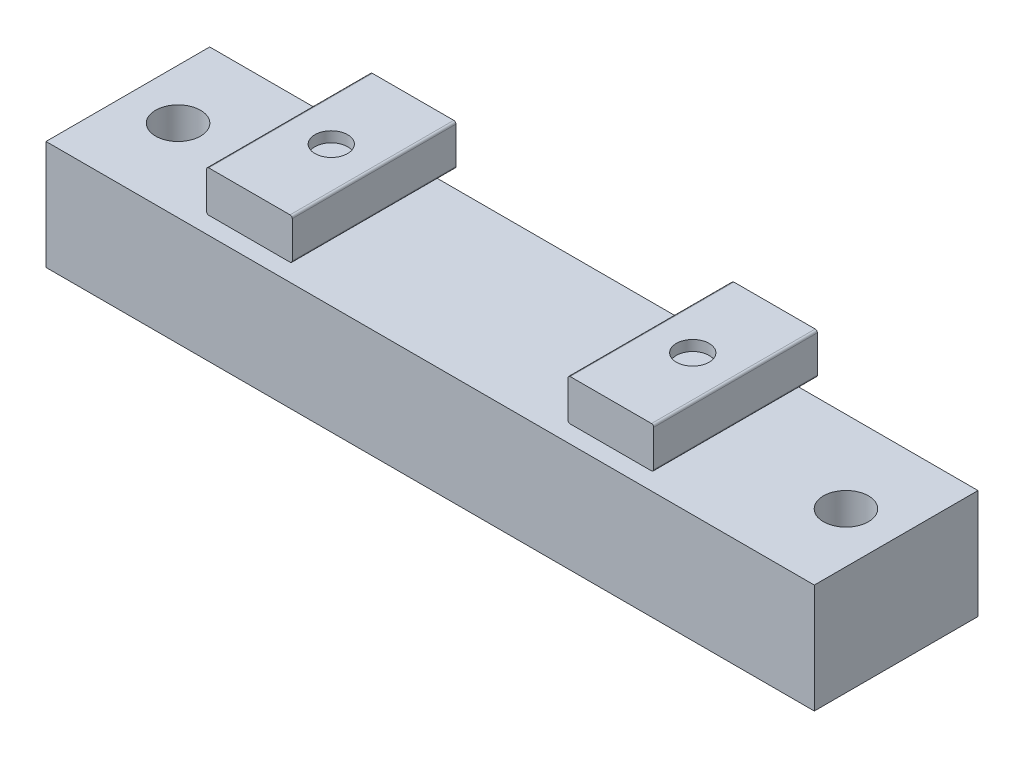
ISO-10303-21;
HEADER;
FILE_DESCRIPTION(('STEP AP214'),'2;1');
FILE_NAME('part.step','',(''),(''),'','','');
FILE_SCHEMA(('AUTOMOTIVE_DESIGN { 1 0 10303 214 1 1 1 1 }'));
ENDSEC;
DATA;
#1=APPLICATION_CONTEXT('core data for automotive mechanical design processes');
#2=APPLICATION_PROTOCOL_DEFINITION('international standard','automotive_design',2000,#1);
#3=PRODUCT_CONTEXT('',#1,'mechanical');
#4=PRODUCT('Part','Part','',(#3));
#5=PRODUCT_RELATED_PRODUCT_CATEGORY('part','',(#4));
#6=PRODUCT_DEFINITION_FORMATION('','',#4);
#7=PRODUCT_DEFINITION_CONTEXT('part definition',#1,'design');
#8=PRODUCT_DEFINITION('design','',#6,#7);
#9=PRODUCT_DEFINITION_SHAPE('','',#8);
#10=(LENGTH_UNIT() NAMED_UNIT(*) SI_UNIT(.MILLI.,.METRE.));
#11=(NAMED_UNIT(*) PLANE_ANGLE_UNIT() SI_UNIT($,.RADIAN.));
#12=(NAMED_UNIT(*) SI_UNIT($,.STERADIAN.) SOLID_ANGLE_UNIT());
#13=UNCERTAINTY_MEASURE_WITH_UNIT(LENGTH_MEASURE(1.E-05),#10,'distance_accuracy_value','');
#14=(GEOMETRIC_REPRESENTATION_CONTEXT(3) GLOBAL_UNCERTAINTY_ASSIGNED_CONTEXT((#13)) GLOBAL_UNIT_ASSIGNED_CONTEXT((#10,
#11,#12)) REPRESENTATION_CONTEXT('',''));
#15=CARTESIAN_POINT('',(0.,0.,0.));
#16=DIRECTION('',(0.,0.,1.));
#17=DIRECTION('',(1.,0.,0.));
#18=AXIS2_PLACEMENT_3D('',#15,#16,#17);
#19=CARTESIAN_POINT('',(21.0312,5.58799516,-2.413));
#20=DIRECTION('',(0.,-1.,0.));
#21=DIRECTION('',(-1.,0.,0.));
#22=AXIS2_PLACEMENT_3D('',#19,#20,#21);
#23=PLANE('',#22);
#24=CARTESIAN_POINT('',(21.0312,5.58799516,0.));
#25=DIRECTION('',(0.,-1.,0.));
#26=DIRECTION('',(0.,0.,-1.));
#27=AXIS2_PLACEMENT_3D('',#24,#25,#26);
#28=CIRCLE('',#27,1.905);
#29=CARTESIAN_POINT('',(21.0312,5.58799516,-1.905));
#30=VERTEX_POINT('',#29);
#31=EDGE_CURVE('E531',#30,#30,#28,.T.);
#32=ORIENTED_EDGE('',*,*,#31,.F.);
#33=EDGE_LOOP('',(#32));
#34=FACE_BOUND('',#33,.T.);
#35=ADVANCED_FACE('F14',(#34),#23,.F.);
#36=CARTESIAN_POINT('',(21.0312,-11.93800484,0.));
#37=DIRECTION('',(0.,-1.,0.));
#38=DIRECTION('',(-1.,0.,0.));
#39=AXIS2_PLACEMENT_3D('',#36,#37,#38);
#40=CYLINDRICAL_SURFACE('',#39,2.413);
#41=CARTESIAN_POINT('',(21.0312,2.03200000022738,0.));
#42=DIRECTION('',(0.,1.,0.));
#43=DIRECTION('',(-1.,0.,0.));
#44=AXIS2_PLACEMENT_3D('',#41,#42,#43);
#45=CIRCLE('',#44,2.413);
#46=CARTESIAN_POINT('',(18.6182,2.03200000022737,0.));
#47=VERTEX_POINT('',#46);
#48=EDGE_CURVE('E22',#47,#47,#45,.T.);
#49=ORIENTED_EDGE('',*,*,#48,.F.);
#50=EDGE_LOOP('',(#49));
#51=FACE_BOUND('',#50,.T.);
#52=CARTESIAN_POINT('',(21.0312,0.,0.));
#53=DIRECTION('',(0.,-1.,0.));
#54=DIRECTION('',(0.,0.,-1.));
#55=AXIS2_PLACEMENT_3D('',#52,#53,#54);
#56=CIRCLE('',#55,2.413);
#57=CARTESIAN_POINT('',(21.0312,0.,-2.413));
#58=VERTEX_POINT('',#57);
#59=EDGE_CURVE('E9',#58,#58,#56,.T.);
#60=ORIENTED_EDGE('',*,*,#59,.F.);
#61=EDGE_LOOP('',(#60));
#62=FACE_BOUND('',#61,.T.);
#63=ADVANCED_FACE('F538',(#51,#62),#40,.T.);
#64=CARTESIAN_POINT('',(-22.5552,-9.65200484,2.52176362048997));
#65=DIRECTION('',(0.,1.,0.));
#66=DIRECTION('',(1.,0.,0.));
#67=AXIS2_PLACEMENT_3D('',#64,#65,#66);
#68=PLANE('',#67);
#69=DIRECTION('',(0.,0.,-1.));
#70=VECTOR('',#69,1.);
#71=CARTESIAN_POINT('',(-22.5552,-9.65200484,0.762));
#72=LINE('',#71,#70);
#73=CARTESIAN_POINT('',(-22.5552,-9.65200484,0.762));
#74=VERTEX_POINT('',#73);
#75=CARTESIAN_POINT('',(-22.5552,-9.65200484,-0.762));
#76=VERTEX_POINT('',#75);
#77=EDGE_CURVE('E429',#74,#76,#72,.T.);
#78=ORIENTED_EDGE('',*,*,#77,.T.);
#79=DIRECTION('',(0.86602540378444,0.,-0.5));
#80=VECTOR('',#79,1.);
#81=CARTESIAN_POINT('',(-22.5552,-9.65200484,-0.762));
#82=LINE('',#81,#80);
#83=CARTESIAN_POINT('',(-21.0312,-9.65200484,-1.64188181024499));
#84=VERTEX_POINT('',#83);
#85=EDGE_CURVE('E432',#76,#84,#82,.T.);
#86=ORIENTED_EDGE('',*,*,#85,.T.);
#87=DIRECTION('',(0.86602540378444,0.,0.5));
#88=VECTOR('',#87,1.);
#89=CARTESIAN_POINT('',(-19.5072,-9.65200484,-0.762));
#90=LINE('',#89,#88);
#91=CARTESIAN_POINT('',(-19.5072,-9.65200484,-0.762));
#92=VERTEX_POINT('',#91);
#93=EDGE_CURVE('E435',#84,#92,#90,.T.);
#94=ORIENTED_EDGE('',*,*,#93,.T.);
#95=DIRECTION('',(0.,0.,1.));
#96=VECTOR('',#95,1.);
#97=CARTESIAN_POINT('',(-19.5072,-9.65200484,0.762));
#98=LINE('',#97,#96);
#99=CARTESIAN_POINT('',(-19.5072,-9.65200484,0.762));
#100=VERTEX_POINT('',#99);
#101=EDGE_CURVE('E438',#92,#100,#98,.T.);
#102=ORIENTED_EDGE('',*,*,#101,.T.);
#103=DIRECTION('',(-0.86602540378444,0.,0.5));
#104=VECTOR('',#103,1.);
#105=CARTESIAN_POINT('',(-19.5072,-9.65200484,0.762));
#106=LINE('',#105,#104);
#107=CARTESIAN_POINT('',(-21.0312,-9.65200484,1.64188181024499));
#108=VERTEX_POINT('',#107);
#109=EDGE_CURVE('E441',#100,#108,#106,.T.);
#110=ORIENTED_EDGE('',*,*,#109,.T.);
#111=DIRECTION('',(-0.86602540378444,0.,-0.5));
#112=VECTOR('',#111,1.);
#113=CARTESIAN_POINT('',(-22.5552,-9.65200484,0.762));
#114=LINE('',#113,#112);
#115=EDGE_CURVE('E444',#108,#74,#114,.T.);
#116=ORIENTED_EDGE('',*,*,#115,.T.);
#117=EDGE_LOOP('',(#78,#86,#94,#102,#110,#116));
#118=FACE_BOUND('',#117,.T.);
#119=ADVANCED_FACE('F541',(#118),#68,.F.);
#120=CARTESIAN_POINT('',(-19.5072,-9.65200484,-0.762));
#121=DIRECTION('',(0.5,0.,-0.86602540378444));
#122=DIRECTION('',(0.86602540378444,0.,0.5));
#123=AXIS2_PLACEMENT_3D('',#120,#121,#122);
#124=PLANE('',#123);
#125=DIRECTION('',(0.86602540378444,0.,0.5));
#126=VECTOR('',#125,1.);
#127=CARTESIAN_POINT('',(-19.5072,-11.93800484,-0.762));
#128=LINE('',#127,#126);
#129=CARTESIAN_POINT('',(-21.0312,-11.93800484,-1.64188181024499));
#130=VERTEX_POINT('',#129);
#131=CARTESIAN_POINT('',(-19.5072,-11.93800484,-0.762));
#132=VERTEX_POINT('',#131);
#133=EDGE_CURVE('E417',#130,#132,#128,.T.);
#134=ORIENTED_EDGE('',*,*,#133,.T.);
#135=DIRECTION('',(0.,-1.,0.));
#136=VECTOR('',#135,1.);
#137=CARTESIAN_POINT('',(-19.5072,-9.65200484,-0.762));
#138=LINE('',#137,#136);
#139=EDGE_CURVE('E455',#92,#132,#138,.T.);
#140=ORIENTED_EDGE('',*,*,#139,.F.);
#141=ORIENTED_EDGE('',*,*,#93,.F.);
#142=DIRECTION('',(0.,-1.,0.));
#143=VECTOR('',#142,1.);
#144=CARTESIAN_POINT('',(-21.0312,-9.65200484,-1.64188181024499));
#145=LINE('',#144,#143);
#146=EDGE_CURVE('E457',#84,#130,#145,.T.);
#147=ORIENTED_EDGE('',*,*,#146,.T.);
#148=EDGE_LOOP('',(#134,#140,#141,#147));
#149=FACE_BOUND('',#148,.T.);
#150=ADVANCED_FACE('F701',(#149),#124,.F.);
#151=CARTESIAN_POINT('',(-19.5072,-9.65200484,0.762));
#152=DIRECTION('',(1.,0.,0.));
#153=DIRECTION('',(0.,0.,1.));
#154=AXIS2_PLACEMENT_3D('',#151,#152,#153);
#155=PLANE('',#154);
#156=DIRECTION('',(0.,0.,1.));
#157=VECTOR('',#156,1.);
#158=CARTESIAN_POINT('',(-19.5072,-11.93800484,0.762));
#159=LINE('',#158,#157);
#160=CARTESIAN_POINT('',(-19.5072,-11.93800484,0.762));
#161=VERTEX_POINT('',#160);
#162=EDGE_CURVE('E420',#132,#161,#159,.T.);
#163=ORIENTED_EDGE('',*,*,#162,.T.);
#164=DIRECTION('',(0.,-1.,0.));
#165=VECTOR('',#164,1.);
#166=CARTESIAN_POINT('',(-19.5072,-9.65200484,0.762));
#167=LINE('',#166,#165);
#168=EDGE_CURVE('E453',#100,#161,#167,.T.);
#169=ORIENTED_EDGE('',*,*,#168,.F.);
#170=ORIENTED_EDGE('',*,*,#101,.F.);
#171=ORIENTED_EDGE('',*,*,#139,.T.);
#172=EDGE_LOOP('',(#163,#169,#170,#171));
#173=FACE_BOUND('',#172,.T.);
#174=ADVANCED_FACE('F711',(#173),#155,.F.);
#175=CARTESIAN_POINT('',(-19.5072,-9.65200484,0.762));
#176=DIRECTION('',(0.5,0.,0.86602540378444));
#177=DIRECTION('',(-0.86602540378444,0.,0.5));
#178=AXIS2_PLACEMENT_3D('',#175,#176,#177);
#179=PLANE('',#178);
#180=DIRECTION('',(-0.86602540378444,0.,0.5));
#181=VECTOR('',#180,1.);
#182=CARTESIAN_POINT('',(-19.5072,-11.93800484,0.762));
#183=LINE('',#182,#181);
#184=CARTESIAN_POINT('',(-21.0312,-11.93800484,1.64188181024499));
#185=VERTEX_POINT('',#184);
#186=EDGE_CURVE('E423',#161,#185,#183,.T.);
#187=ORIENTED_EDGE('',*,*,#186,.T.);
#188=DIRECTION('',(0.,-1.,0.));
#189=VECTOR('',#188,1.);
#190=CARTESIAN_POINT('',(-21.0312,-9.65200484,1.64188181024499));
#191=LINE('',#190,#189);
#192=EDGE_CURVE('E451',#108,#185,#191,.T.);
#193=ORIENTED_EDGE('',*,*,#192,.F.);
#194=ORIENTED_EDGE('',*,*,#109,.F.);
#195=ORIENTED_EDGE('',*,*,#168,.T.);
#196=EDGE_LOOP('',(#187,#193,#194,#195));
#197=FACE_BOUND('',#196,.T.);
#198=ADVANCED_FACE('F707',(#197),#179,.F.);
#199=CARTESIAN_POINT('',(-22.5552,-9.65200484,0.762));
#200=DIRECTION('',(-0.5,0.,0.86602540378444));
#201=DIRECTION('',(-0.86602540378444,0.,-0.5));
#202=AXIS2_PLACEMENT_3D('',#199,#200,#201);
#203=PLANE('',#202);
#204=DIRECTION('',(-0.86602540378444,0.,-0.5));
#205=VECTOR('',#204,1.);
#206=CARTESIAN_POINT('',(-22.5552,-11.93800484,0.762));
#207=LINE('',#206,#205);
#208=CARTESIAN_POINT('',(-22.5552,-11.93800484,0.762));
#209=VERTEX_POINT('',#208);
#210=EDGE_CURVE('E426',#185,#209,#207,.T.);
#211=ORIENTED_EDGE('',*,*,#210,.T.);
#212=DIRECTION('',(0.,-1.,0.));
#213=VECTOR('',#212,1.);
#214=CARTESIAN_POINT('',(-22.5552,-9.65200484,0.762));
#215=LINE('',#214,#213);
#216=EDGE_CURVE('E448',#74,#209,#215,.T.);
#217=ORIENTED_EDGE('',*,*,#216,.F.);
#218=ORIENTED_EDGE('',*,*,#115,.F.);
#219=ORIENTED_EDGE('',*,*,#192,.T.);
#220=EDGE_LOOP('',(#211,#217,#218,#219));
#221=FACE_BOUND('',#220,.T.);
#222=ADVANCED_FACE('F703',(#221),#203,.F.);
#223=CARTESIAN_POINT('',(-22.5552,-9.65200484,0.762));
#224=DIRECTION('',(-1.,0.,0.));
#225=DIRECTION('',(0.,0.,-1.));
#226=AXIS2_PLACEMENT_3D('',#223,#224,#225);
#227=PLANE('',#226);
#228=DIRECTION('',(0.,0.,-1.));
#229=VECTOR('',#228,1.);
#230=CARTESIAN_POINT('',(-22.5552,-11.93800484,0.762));
#231=LINE('',#230,#229);
#232=CARTESIAN_POINT('',(-22.5552,-11.93800484,-0.762));
#233=VERTEX_POINT('',#232);
#234=EDGE_CURVE('E412',#209,#233,#231,.T.);
#235=ORIENTED_EDGE('',*,*,#234,.T.);
#236=DIRECTION('',(0.,-1.,0.));
#237=VECTOR('',#236,1.);
#238=CARTESIAN_POINT('',(-22.5552,-9.65200484,-0.762));
#239=LINE('',#238,#237);
#240=EDGE_CURVE('E447',#76,#233,#239,.T.);
#241=ORIENTED_EDGE('',*,*,#240,.F.);
#242=ORIENTED_EDGE('',*,*,#77,.F.);
#243=ORIENTED_EDGE('',*,*,#216,.T.);
#244=EDGE_LOOP('',(#235,#241,#242,#243));
#245=FACE_BOUND('',#244,.T.);
#246=ADVANCED_FACE('F706',(#245),#227,.F.);
#247=CARTESIAN_POINT('',(-22.5552,-9.65200484,-0.762));
#248=DIRECTION('',(-0.5,0.,-0.86602540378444));
#249=DIRECTION('',(0.86602540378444,0.,-0.5));
#250=AXIS2_PLACEMENT_3D('',#247,#248,#249);
#251=PLANE('',#250);
#252=DIRECTION('',(0.86602540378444,0.,-0.5));
#253=VECTOR('',#252,1.);
#254=CARTESIAN_POINT('',(-22.5552,-11.93800484,-0.762));
#255=LINE('',#254,#253);
#256=EDGE_CURVE('E414',#233,#130,#255,.T.);
#257=ORIENTED_EDGE('',*,*,#256,.T.);
#258=ORIENTED_EDGE('',*,*,#146,.F.);
#259=ORIENTED_EDGE('',*,*,#85,.F.);
#260=ORIENTED_EDGE('',*,*,#240,.T.);
#261=EDGE_LOOP('',(#257,#258,#259,#260));
#262=FACE_BOUND('',#261,.T.);
#263=ADVANCED_FACE('F719',(#262),#251,.F.);
#264=CARTESIAN_POINT('',(-21.0312,-11.93800484,0.));
#265=DIRECTION('',(0.,1.,0.));
#266=DIRECTION('',(1.,0.,0.));
#267=AXIS2_PLACEMENT_3D('',#264,#265,#266);
#268=PLANE('',#267);
#269=ORIENTED_EDGE('',*,*,#256,.F.);
#270=ORIENTED_EDGE('',*,*,#234,.F.);
#271=ORIENTED_EDGE('',*,*,#210,.F.);
#272=ORIENTED_EDGE('',*,*,#186,.F.);
#273=ORIENTED_EDGE('',*,*,#162,.F.);
#274=ORIENTED_EDGE('',*,*,#133,.F.);
#275=EDGE_LOOP('',(#269,#270,#271,#272,#273,#274));
#276=FACE_BOUND('',#275,.T.);
#277=CARTESIAN_POINT('',(-21.0312,-11.93800484,0.));
#278=DIRECTION('',(0.,-1.,0.));
#279=DIRECTION('',(-1.,0.,0.));
#280=AXIS2_PLACEMENT_3D('',#277,#278,#279);
#281=CIRCLE('',#280,3.2004);
#282=CARTESIAN_POINT('',(-24.2316,-11.93800484,0.));
#283=VERTEX_POINT('',#282);
#284=EDGE_CURVE('E466',#283,#283,#281,.T.);
#285=ORIENTED_EDGE('',*,*,#284,.T.);
#286=EDGE_LOOP('',(#285));
#287=FACE_BOUND('',#286,.T.);
#288=ADVANCED_FACE('F722',(#276,#287),#268,.F.);
#289=CARTESIAN_POINT('',(-21.0312,-11.17600484,0.));
#290=DIRECTION('',(0.,1.,0.));
#291=DIRECTION('',(1.,0.,0.));
#292=AXIS2_PLACEMENT_3D('',#289,#290,#291);
#293=CONICAL_SURFACE('',#292,3.9624,0.78539816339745);
#294=ORIENTED_EDGE('',*,*,#284,.F.);
#295=EDGE_LOOP('',(#294));
#296=FACE_BOUND('',#295,.T.);
#297=CARTESIAN_POINT('',(-21.0312,-11.17600484,0.));
#298=DIRECTION('',(0.,-1.,0.));
#299=DIRECTION('',(-1.,0.,0.));
#300=AXIS2_PLACEMENT_3D('',#297,#298,#299);
#301=CIRCLE('',#300,3.9624);
#302=CARTESIAN_POINT('',(-24.9936,-11.17600484,0.));
#303=VERTEX_POINT('',#302);
#304=EDGE_CURVE('E463',#303,#303,#301,.T.);
#305=ORIENTED_EDGE('',*,*,#304,.T.);
#306=EDGE_LOOP('',(#305));
#307=FACE_BOUND('',#306,.T.);
#308=ADVANCED_FACE('F729',(#296,#307),#293,.T.);
#309=CARTESIAN_POINT('',(-21.0312,5.58799516,-2.413));
#310=DIRECTION('',(0.,-1.,0.));
#311=DIRECTION('',(-1.,0.,0.));
#312=AXIS2_PLACEMENT_3D('',#309,#310,#311);
#313=PLANE('',#312);
#314=CARTESIAN_POINT('',(-21.0312,5.58799516,0.));
#315=DIRECTION('',(0.,-1.,0.));
#316=DIRECTION('',(0.,0.,-1.));
#317=AXIS2_PLACEMENT_3D('',#314,#315,#316);
#318=CIRCLE('',#317,1.905);
#319=CARTESIAN_POINT('',(-21.0312,5.58799516,-1.905));
#320=VERTEX_POINT('',#319);
#321=EDGE_CURVE('E469',#320,#320,#318,.T.);
#322=ORIENTED_EDGE('',*,*,#321,.F.);
#323=EDGE_LOOP('',(#322));
#324=FACE_BOUND('',#323,.T.);
#325=ADVANCED_FACE('F727',(#324),#313,.F.);
#326=CARTESIAN_POINT('',(-21.0312,-11.93800484,0.));
#327=DIRECTION('',(0.,-1.,0.));
#328=DIRECTION('',(-1.,0.,0.));
#329=AXIS2_PLACEMENT_3D('',#326,#327,#328);
#330=CYLINDRICAL_SURFACE('',#329,3.9624);
#331=ORIENTED_EDGE('',*,*,#304,.F.);
#332=EDGE_LOOP('',(#331));
#333=FACE_BOUND('',#332,.T.);
#334=CARTESIAN_POINT('',(-21.0312,-7.11200484,0.));
#335=DIRECTION('',(0.,-1.,0.));
#336=DIRECTION('',(-1.,0.,0.));
#337=AXIS2_PLACEMENT_3D('',#334,#335,#336);
#338=CIRCLE('',#337,3.9624);
#339=CARTESIAN_POINT('',(-24.9936,-7.11200484,0.));
#340=VERTEX_POINT('',#339);
#341=EDGE_CURVE('E450',#340,#340,#338,.T.);
#342=ORIENTED_EDGE('',*,*,#341,.T.);
#343=EDGE_LOOP('',(#342));
#344=FACE_BOUND('',#343,.T.);
#345=ADVANCED_FACE('F662',(#333,#344),#330,.T.);
#346=CARTESIAN_POINT('',(-21.0312,2.03200000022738,0.));
#347=DIRECTION('',(0.,1.,0.));
#348=DIRECTION('',(0.,0.,1.));
#349=AXIS2_PLACEMENT_3D('',#346,#347,#348);
#350=CYLINDRICAL_SURFACE('',#349,1.905);
#351=CARTESIAN_POINT('',(-21.0312,6.80720000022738,0.));
#352=DIRECTION('',(0.,1.,0.));
#353=DIRECTION('',(0.,0.,1.));
#354=AXIS2_PLACEMENT_3D('',#351,#352,#353);
#355=CIRCLE('',#354,1.905);
#356=CARTESIAN_POINT('',(-21.0312,6.80720000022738,1.905));
#357=VERTEX_POINT('',#356);
#358=EDGE_CURVE('E351',#357,#357,#355,.T.);
#359=ORIENTED_EDGE('',*,*,#358,.T.);
#360=EDGE_LOOP('',(#359));
#361=FACE_BOUND('',#360,.T.);
#362=ORIENTED_EDGE('',*,*,#321,.T.);
#363=EDGE_LOOP('',(#362));
#364=FACE_BOUND('',#363,.T.);
#365=ADVANCED_FACE('F613',(#361,#364),#350,.F.);
#366=CARTESIAN_POINT('',(-18.224502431,-7.11200484,0.));
#367=DIRECTION('',(0.,1.,0.));
#368=DIRECTION('',(0.,0.,1.));
#369=AXIS2_PLACEMENT_3D('',#366,#367,#368);
#370=PLANE('',#369);
#371=ORIENTED_EDGE('',*,*,#341,.F.);
#372=EDGE_LOOP('',(#371));
#373=FACE_BOUND('',#372,.T.);
#374=CARTESIAN_POINT('',(-21.0312,-7.11200484,0.));
#375=DIRECTION('',(0.,-1.,0.));
#376=DIRECTION('',(0.,0.,-1.));
#377=AXIS2_PLACEMENT_3D('',#374,#375,#376);
#378=CIRCLE('',#377,4.762495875);
#379=CARTESIAN_POINT('',(-21.0312,-7.11200484,-4.762495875));
#380=VERTEX_POINT('',#379);
#381=EDGE_CURVE('E306',#380,#380,#378,.T.);
#382=ORIENTED_EDGE('',*,*,#381,.T.);
#383=EDGE_LOOP('',(#382));
#384=FACE_BOUND('',#383,.T.);
#385=ADVANCED_FACE('F609',(#373,#384),#370,.F.);
#386=CARTESIAN_POINT('',(-25.76195,6.80720000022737,9.525));
#387=DIRECTION('',(0.,-1.,0.));
#388=DIRECTION('',(0.,0.,-1.));
#389=AXIS2_PLACEMENT_3D('',#386,#387,#388);
#390=PLANE('',#389);
#391=ORIENTED_EDGE('',*,*,#358,.F.);
#392=EDGE_LOOP('',(#391));
#393=FACE_BOUND('',#392,.T.);
#394=DIRECTION('',(-1.,0.,0.));
#395=VECTOR('',#394,1.);
#396=CARTESIAN_POINT('',(-25.76195,6.80720000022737,-9.525));
#397=LINE('',#396,#395);
#398=CARTESIAN_POINT('',(-16.30045,6.80720000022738,-9.525));
#399=VERTEX_POINT('',#398);
#400=CARTESIAN_POINT('',(-25.76195,6.80720000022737,-9.525));
#401=VERTEX_POINT('',#400);
#402=EDGE_CURVE('E357',#399,#401,#397,.T.);
#403=ORIENTED_EDGE('',*,*,#402,.T.);
#404=DIRECTION('',(0.,0.,-1.));
#405=VECTOR('',#404,1.);
#406=CARTESIAN_POINT('',(-25.76195,6.80720000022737,9.525));
#407=LINE('',#406,#405);
#408=CARTESIAN_POINT('',(-25.76195,6.80720000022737,9.525));
#409=VERTEX_POINT('',#408);
#410=EDGE_CURVE('E406',#409,#401,#407,.T.);
#411=ORIENTED_EDGE('',*,*,#410,.F.);
#412=DIRECTION('',(-1.,0.,0.));
#413=VECTOR('',#412,1.);
#414=CARTESIAN_POINT('',(-25.76195,6.80720000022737,9.525));
#415=LINE('',#414,#413);
#416=CARTESIAN_POINT('',(-16.30045,6.80720000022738,9.525));
#417=VERTEX_POINT('',#416);
#418=EDGE_CURVE('E374',#417,#409,#415,.T.);
#419=ORIENTED_EDGE('',*,*,#418,.F.);
#420=DIRECTION('',(0.,0.,-1.));
#421=VECTOR('',#420,1.);
#422=CARTESIAN_POINT('',(-16.30045,6.80720000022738,9.525));
#423=LINE('',#422,#421);
#424=EDGE_CURVE('E409',#417,#399,#423,.T.);
#425=ORIENTED_EDGE('',*,*,#424,.T.);
#426=EDGE_LOOP('',(#403,#411,#419,#425));
#427=FACE_BOUND('',#426,.T.);
#428=ADVANCED_FACE('F612',(#393,#427),#390,.F.);
#429=CARTESIAN_POINT('',(-25.76195,6.55320000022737,9.525));
#430=DIRECTION('',(0.,0.,-1.));
#431=DIRECTION('',(0.,1.,0.));
#432=AXIS2_PLACEMENT_3D('',#429,#430,#431);
#433=CYLINDRICAL_SURFACE('',#432,0.254);
#434=CARTESIAN_POINT('',(-25.76195,6.55320000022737,-9.525));
#435=DIRECTION('',(0.,0.,1.));
#436=DIRECTION('',(0.,-1.,0.));
#437=AXIS2_PLACEMENT_3D('',#434,#435,#436);
#438=CIRCLE('',#437,0.254);
#439=CARTESIAN_POINT('',(-26.01595,6.55320000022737,-9.525));
#440=VERTEX_POINT('',#439);
#441=EDGE_CURVE('E359',#401,#440,#438,.T.);
#442=ORIENTED_EDGE('',*,*,#441,.T.);
#443=DIRECTION('',(0.,0.,-1.));
#444=VECTOR('',#443,1.);
#445=CARTESIAN_POINT('',(-26.01595,6.55320000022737,9.525));
#446=LINE('',#445,#444);
#447=CARTESIAN_POINT('',(-26.01595,6.55320000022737,9.525));
#448=VERTEX_POINT('',#447);
#449=EDGE_CURVE('E403',#448,#440,#446,.T.);
#450=ORIENTED_EDGE('',*,*,#449,.F.);
#451=CARTESIAN_POINT('',(-25.76195,6.55320000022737,9.525));
#452=DIRECTION('',(0.,0.,1.));
#453=DIRECTION('',(0.,-1.,0.));
#454=AXIS2_PLACEMENT_3D('',#451,#452,#453);
#455=CIRCLE('',#454,0.254);
#456=EDGE_CURVE('E376',#409,#448,#455,.T.);
#457=ORIENTED_EDGE('',*,*,#456,.F.);
#458=ORIENTED_EDGE('',*,*,#410,.T.);
#459=EDGE_LOOP('',(#442,#450,#457,#458));
#460=FACE_BOUND('',#459,.T.);
#461=ADVANCED_FACE('F688',(#460),#433,.T.);
#462=CARTESIAN_POINT('',(-26.01595,6.55320000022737,9.525));
#463=DIRECTION('',(1.,0.,0.));
#464=DIRECTION('',(0.,0.,1.));
#465=AXIS2_PLACEMENT_3D('',#462,#463,#464);
#466=PLANE('',#465);
#467=DIRECTION('',(0.,-1.,0.));
#468=VECTOR('',#467,1.);
#469=CARTESIAN_POINT('',(-26.01595,6.55320000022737,-9.525));
#470=LINE('',#469,#468);
#471=CARTESIAN_POINT('',(-26.01595,2.28600000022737,-9.525));
#472=VERTEX_POINT('',#471);
#473=EDGE_CURVE('E361',#440,#472,#470,.T.);
#474=ORIENTED_EDGE('',*,*,#473,.T.);
#475=DIRECTION('',(0.,0.,-1.));
#476=VECTOR('',#475,1.);
#477=CARTESIAN_POINT('',(-26.01595,2.28600000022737,9.525));
#478=LINE('',#477,#476);
#479=CARTESIAN_POINT('',(-26.01595,2.28600000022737,9.525));
#480=VERTEX_POINT('',#479);
#481=EDGE_CURVE('E400',#480,#472,#478,.T.);
#482=ORIENTED_EDGE('',*,*,#481,.F.);
#483=DIRECTION('',(0.,-1.,0.));
#484=VECTOR('',#483,1.);
#485=CARTESIAN_POINT('',(-26.01595,6.55320000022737,9.525));
#486=LINE('',#485,#484);
#487=EDGE_CURVE('E378',#448,#480,#486,.T.);
#488=ORIENTED_EDGE('',*,*,#487,.F.);
#489=ORIENTED_EDGE('',*,*,#449,.T.);
#490=EDGE_LOOP('',(#474,#482,#488,#489));
#491=FACE_BOUND('',#490,.T.);
#492=ADVANCED_FACE('F675',(#491),#466,.F.);
#493=CARTESIAN_POINT('',(-16.04645,6.55320000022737,9.525));
#494=DIRECTION('',(-1.,0.,0.));
#495=DIRECTION('',(0.,-1.,0.));
#496=AXIS2_PLACEMENT_3D('',#493,#494,#495);
#497=PLANE('',#496);
#498=DIRECTION('',(0.,1.,0.));
#499=VECTOR('',#498,1.);
#500=CARTESIAN_POINT('',(-16.04645,6.55320000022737,-9.525));
#501=LINE('',#500,#499);
#502=CARTESIAN_POINT('',(-16.04645,2.28600000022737,-9.525));
#503=VERTEX_POINT('',#502);
#504=CARTESIAN_POINT('',(-16.04645,6.55320000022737,-9.525));
#505=VERTEX_POINT('',#504);
#506=EDGE_CURVE('E369',#503,#505,#501,.T.);
#507=ORIENTED_EDGE('',*,*,#506,.T.);
#508=DIRECTION('',(0.,0.,-1.));
#509=VECTOR('',#508,1.);
#510=CARTESIAN_POINT('',(-16.04645,6.55320000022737,9.525));
#511=LINE('',#510,#509);
#512=CARTESIAN_POINT('',(-16.04645,6.55320000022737,9.525));
#513=VERTEX_POINT('',#512);
#514=EDGE_CURVE('E388',#513,#505,#511,.T.);
#515=ORIENTED_EDGE('',*,*,#514,.F.);
#516=DIRECTION('',(0.,1.,0.));
#517=VECTOR('',#516,1.);
#518=CARTESIAN_POINT('',(-16.04645,6.55320000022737,9.525));
#519=LINE('',#518,#517);
#520=CARTESIAN_POINT('',(-16.04645,2.28600000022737,9.525));
#521=VERTEX_POINT('',#520);
#522=EDGE_CURVE('E386',#521,#513,#519,.T.);
#523=ORIENTED_EDGE('',*,*,#522,.F.);
#524=DIRECTION('',(0.,0.,-1.));
#525=VECTOR('',#524,1.);
#526=CARTESIAN_POINT('',(-16.04645,2.28600000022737,9.525));
#527=LINE('',#526,#525);
#528=EDGE_CURVE('E391',#521,#503,#527,.T.);
#529=ORIENTED_EDGE('',*,*,#528,.T.);
#530=EDGE_LOOP('',(#507,#515,#523,#529));
#531=FACE_BOUND('',#530,.T.);
#532=ADVANCED_FACE('F672',(#531),#497,.F.);
#533=CARTESIAN_POINT('',(-16.30045,6.55320000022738,9.525));
#534=DIRECTION('',(0.,0.,-1.));
#535=DIRECTION('',(0.,1.,0.));
#536=AXIS2_PLACEMENT_3D('',#533,#534,#535);
#537=CYLINDRICAL_SURFACE('',#536,0.254);
#538=CARTESIAN_POINT('',(-16.30045,6.55320000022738,-9.525));
#539=DIRECTION('',(0.,0.,1.));
#540=DIRECTION('',(0.,-1.,0.));
#541=AXIS2_PLACEMENT_3D('',#538,#539,#540);
#542=CIRCLE('',#541,0.254);
#543=EDGE_CURVE('E354',#505,#399,#542,.T.);
#544=ORIENTED_EDGE('',*,*,#543,.T.);
#545=ORIENTED_EDGE('',*,*,#424,.F.);
#546=CARTESIAN_POINT('',(-16.30045,6.55320000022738,9.525));
#547=DIRECTION('',(0.,0.,1.));
#548=DIRECTION('',(0.,-1.,0.));
#549=AXIS2_PLACEMENT_3D('',#546,#547,#548);
#550=CIRCLE('',#549,0.254);
#551=EDGE_CURVE('E371',#513,#417,#550,.T.);
#552=ORIENTED_EDGE('',*,*,#551,.F.);
#553=ORIENTED_EDGE('',*,*,#514,.T.);
#554=EDGE_LOOP('',(#544,#545,#552,#553));
#555=FACE_BOUND('',#554,.T.);
#556=ADVANCED_FACE('F607',(#555),#537,.T.);
#557=CARTESIAN_POINT('',(-21.0312,-12.7,0.));
#558=DIRECTION('',(0.,-1.,0.));
#559=DIRECTION('',(0.,0.,-1.));
#560=AXIS2_PLACEMENT_3D('',#557,#558,#559);
#561=CYLINDRICAL_SURFACE('',#560,4.762495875);
#562=ORIENTED_EDGE('',*,*,#381,.F.);
#563=EDGE_LOOP('',(#562));
#564=FACE_BOUND('',#563,.T.);
#565=CARTESIAN_POINT('',(-21.0312,-12.7,0.));
#566=DIRECTION('',(0.,-1.,0.));
#567=DIRECTION('',(0.,0.,-1.));
#568=AXIS2_PLACEMENT_3D('',#565,#566,#567);
#569=CIRCLE('',#568,4.762495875);
#570=CARTESIAN_POINT('',(-21.0312,-12.7,-4.762495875));
#571=VERTEX_POINT('',#570);
#572=EDGE_CURVE('E303',#571,#571,#569,.T.);
#573=ORIENTED_EDGE('',*,*,#572,.T.);
#574=EDGE_LOOP('',(#573));
#575=FACE_BOUND('',#574,.T.);
#576=ADVANCED_FACE('F603',(#564,#575),#561,.F.);
#577=CARTESIAN_POINT('',(-25.76195,2.28600000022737,9.525));
#578=DIRECTION('',(0.,0.,-1.));
#579=DIRECTION('',(0.,1.,0.));
#580=AXIS2_PLACEMENT_3D('',#577,#578,#579);
#581=CYLINDRICAL_SURFACE('',#580,0.254);
#582=CARTESIAN_POINT('',(-25.76195,2.28600000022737,-9.525));
#583=DIRECTION('',(0.,0.,1.));
#584=DIRECTION('',(0.,-1.,0.));
#585=AXIS2_PLACEMENT_3D('',#582,#583,#584);
#586=CIRCLE('',#585,0.254);
#587=CARTESIAN_POINT('',(-25.76195,2.03200000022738,-9.525));
#588=VERTEX_POINT('',#587);
#589=EDGE_CURVE('E363',#472,#588,#586,.T.);
#590=ORIENTED_EDGE('',*,*,#589,.T.);
#591=DIRECTION('',(0.,0.,-1.));
#592=VECTOR('',#591,1.);
#593=CARTESIAN_POINT('',(-25.76195,2.03200000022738,9.525));
#594=LINE('',#593,#592);
#595=CARTESIAN_POINT('',(-25.76195,2.03200000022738,9.525));
#596=VERTEX_POINT('',#595);
#597=EDGE_CURVE('E397',#596,#588,#594,.T.);
#598=ORIENTED_EDGE('',*,*,#597,.F.);
#599=CARTESIAN_POINT('',(-25.76195,2.28600000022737,9.525));
#600=DIRECTION('',(0.,0.,1.));
#601=DIRECTION('',(0.,-1.,0.));
#602=AXIS2_PLACEMENT_3D('',#599,#600,#601);
#603=CIRCLE('',#602,0.254);
#604=EDGE_CURVE('E380',#480,#596,#603,.T.);
#605=ORIENTED_EDGE('',*,*,#604,.F.);
#606=ORIENTED_EDGE('',*,*,#481,.T.);
#607=EDGE_LOOP('',(#590,#598,#605,#606));
#608=FACE_BOUND('',#607,.T.);
#609=ADVANCED_FACE('F606',(#608),#581,.T.);
#610=CARTESIAN_POINT('',(-16.30045,6.55320000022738,9.525));
#611=DIRECTION('',(0.,0.,1.));
#612=DIRECTION('',(0.,-1.,0.));
#613=AXIS2_PLACEMENT_3D('',#610,#611,#612);
#614=PLANE('',#613);
#615=ORIENTED_EDGE('',*,*,#551,.T.);
#616=ORIENTED_EDGE('',*,*,#418,.T.);
#617=ORIENTED_EDGE('',*,*,#456,.T.);
#618=ORIENTED_EDGE('',*,*,#487,.T.);
#619=ORIENTED_EDGE('',*,*,#604,.T.);
#620=DIRECTION('',(1.,0.,0.));
#621=VECTOR('',#620,1.);
#622=CARTESIAN_POINT('',(-25.76195,2.03200000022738,9.525));
#623=LINE('',#622,#621);
#624=CARTESIAN_POINT('',(-16.30045,2.03200000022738,9.525));
#625=VERTEX_POINT('',#624);
#626=EDGE_CURVE('E382',#596,#625,#623,.T.);
#627=ORIENTED_EDGE('',*,*,#626,.T.);
#628=CARTESIAN_POINT('',(-16.30045,2.28600000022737,9.525));
#629=DIRECTION('',(0.,0.,1.));
#630=DIRECTION('',(0.,-1.,0.));
#631=AXIS2_PLACEMENT_3D('',#628,#629,#630);
#632=CIRCLE('',#631,0.254);
#633=EDGE_CURVE('E384',#625,#521,#632,.T.);
#634=ORIENTED_EDGE('',*,*,#633,.T.);
#635=ORIENTED_EDGE('',*,*,#522,.T.);
#636=EDGE_LOOP('',(#615,#616,#617,#618,#619,#627,#634,#635));
#637=FACE_BOUND('',#636,.T.);
#638=ADVANCED_FACE('F668',(#637),#614,.T.);
#639=CARTESIAN_POINT('',(-16.30045,2.28600000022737,9.525));
#640=DIRECTION('',(0.,0.,-1.));
#641=DIRECTION('',(0.,1.,0.));
#642=AXIS2_PLACEMENT_3D('',#639,#640,#641);
#643=CYLINDRICAL_SURFACE('',#642,0.254);
#644=CARTESIAN_POINT('',(-16.30045,2.28600000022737,-9.525));
#645=DIRECTION('',(0.,0.,1.));
#646=DIRECTION('',(0.,-1.,0.));
#647=AXIS2_PLACEMENT_3D('',#644,#645,#646);
#648=CIRCLE('',#647,0.254);
#649=CARTESIAN_POINT('',(-16.30045,2.03200000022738,-9.525));
#650=VERTEX_POINT('',#649);
#651=EDGE_CURVE('E367',#650,#503,#648,.T.);
#652=ORIENTED_EDGE('',*,*,#651,.T.);
#653=ORIENTED_EDGE('',*,*,#528,.F.);
#654=ORIENTED_EDGE('',*,*,#633,.F.);
#655=DIRECTION('',(0.,0.,-1.));
#656=VECTOR('',#655,1.);
#657=CARTESIAN_POINT('',(-16.30045,2.03200000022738,9.525));
#658=LINE('',#657,#656);
#659=EDGE_CURVE('E394',#625,#650,#658,.T.);
#660=ORIENTED_EDGE('',*,*,#659,.T.);
#661=EDGE_LOOP('',(#652,#653,#654,#660));
#662=FACE_BOUND('',#661,.T.);
#663=ADVANCED_FACE('F666',(#662),#643,.T.);
#664=CARTESIAN_POINT('',(-16.30045,6.55320000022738,-9.525));
#665=DIRECTION('',(0.,0.,1.));
#666=DIRECTION('',(0.,-1.,0.));
#667=AXIS2_PLACEMENT_3D('',#664,#665,#666);
#668=PLANE('',#667);
#669=ORIENTED_EDGE('',*,*,#543,.F.);
#670=ORIENTED_EDGE('',*,*,#506,.F.);
#671=ORIENTED_EDGE('',*,*,#651,.F.);
#672=DIRECTION('',(1.,0.,0.));
#673=VECTOR('',#672,1.);
#674=CARTESIAN_POINT('',(-25.76195,2.03200000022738,-9.525));
#675=LINE('',#674,#673);
#676=EDGE_CURVE('E365',#588,#650,#675,.T.);
#677=ORIENTED_EDGE('',*,*,#676,.F.);
#678=ORIENTED_EDGE('',*,*,#589,.F.);
#679=ORIENTED_EDGE('',*,*,#473,.F.);
#680=ORIENTED_EDGE('',*,*,#441,.F.);
#681=ORIENTED_EDGE('',*,*,#402,.F.);
#682=EDGE_LOOP('',(#669,#670,#671,#677,#678,#679,#680,#681));
#683=FACE_BOUND('',#682,.T.);
#684=ADVANCED_FACE('F597',(#683),#668,.F.);
#685=CARTESIAN_POINT('',(21.0312,-12.7,0.));
#686=DIRECTION('',(0.,-1.,0.));
#687=DIRECTION('',(0.,0.,-1.));
#688=AXIS2_PLACEMENT_3D('',#685,#686,#687);
#689=CYLINDRICAL_SURFACE('',#688,4.762495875);
#690=CARTESIAN_POINT('',(21.0312,-7.11200484,0.));
#691=DIRECTION('',(0.,-1.,0.));
#692=DIRECTION('',(0.,0.,-1.));
#693=AXIS2_PLACEMENT_3D('',#690,#691,#692);
#694=CIRCLE('',#693,4.762495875);
#695=CARTESIAN_POINT('',(21.0312,-7.11200484,-4.762495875));
#696=VERTEX_POINT('',#695);
#697=EDGE_CURVE('E300',#696,#696,#694,.T.);
#698=ORIENTED_EDGE('',*,*,#697,.F.);
#699=EDGE_LOOP('',(#698));
#700=FACE_BOUND('',#699,.T.);
#701=CARTESIAN_POINT('',(21.0312,-12.7,0.));
#702=DIRECTION('',(0.,-1.,0.));
#703=DIRECTION('',(0.,0.,-1.));
#704=AXIS2_PLACEMENT_3D('',#701,#702,#703);
#705=CIRCLE('',#704,4.762495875);
#706=CARTESIAN_POINT('',(21.0312,-12.7,-4.762495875));
#707=VERTEX_POINT('',#706);
#708=EDGE_CURVE('E243',#707,#707,#705,.T.);
#709=ORIENTED_EDGE('',*,*,#708,.T.);
#710=EDGE_LOOP('',(#709));
#711=FACE_BOUND('',#710,.T.);
#712=ADVANCED_FACE('F593',(#700,#711),#689,.F.);
#713=CARTESIAN_POINT('',(23.837897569,-7.11200484,0.));
#714=DIRECTION('',(0.,1.,0.));
#715=DIRECTION('',(0.,0.,1.));
#716=AXIS2_PLACEMENT_3D('',#713,#714,#715);
#717=PLANE('',#716);
#718=CARTESIAN_POINT('',(21.0312,-7.11200484,0.));
#719=DIRECTION('',(0.,-1.,0.));
#720=DIRECTION('',(-1.,0.,0.));
#721=AXIS2_PLACEMENT_3D('',#718,#719,#720);
#722=CIRCLE('',#721,3.9624);
#723=CARTESIAN_POINT('',(17.0688,-7.11200484,0.));
#724=VERTEX_POINT('',#723);
#725=EDGE_CURVE('E513',#724,#724,#722,.T.);
#726=ORIENTED_EDGE('',*,*,#725,.F.);
#727=EDGE_LOOP('',(#726));
#728=FACE_BOUND('',#727,.T.);
#729=ORIENTED_EDGE('',*,*,#697,.T.);
#730=EDGE_LOOP('',(#729));
#731=FACE_BOUND('',#730,.T.);
#732=ADVANCED_FACE('F596',(#728,#731),#717,.F.);
#733=CARTESIAN_POINT('',(44.704,-12.7,-9.525));
#734=DIRECTION('',(0.,-1.,0.));
#735=DIRECTION('',(0.,0.,-1.));
#736=AXIS2_PLACEMENT_3D('',#733,#734,#735);
#737=PLANE('',#736);
#738=ORIENTED_EDGE('',*,*,#708,.F.);
#739=EDGE_LOOP('',(#738));
#740=FACE_BOUND('',#739,.T.);
#741=ORIENTED_EDGE('',*,*,#572,.F.);
#742=EDGE_LOOP('',(#741));
#743=FACE_BOUND('',#742,.T.);
#744=CARTESIAN_POINT('',(38.862,-12.7,0.));
#745=DIRECTION('',(0.,-1.,0.));
#746=DIRECTION('',(0.,0.,-1.));
#747=AXIS2_PLACEMENT_3D('',#744,#745,#746);
#748=CIRCLE('',#747,2.6162);
#749=CARTESIAN_POINT('',(38.862,-12.7,-2.6162));
#750=VERTEX_POINT('',#749);
#751=EDGE_CURVE('E312',#750,#750,#748,.T.);
#752=ORIENTED_EDGE('',*,*,#751,.F.);
#753=EDGE_LOOP('',(#752));
#754=FACE_BOUND('',#753,.T.);
#755=CARTESIAN_POINT('',(-38.862,-12.7,0.));
#756=DIRECTION('',(0.,-1.,0.));
#757=DIRECTION('',(0.,0.,-1.));
#758=AXIS2_PLACEMENT_3D('',#755,#756,#757);
#759=CIRCLE('',#758,2.6162);
#760=CARTESIAN_POINT('',(-38.862,-12.7,-2.6162));
#761=VERTEX_POINT('',#760);
#762=EDGE_CURVE('E315',#761,#761,#759,.T.);
#763=ORIENTED_EDGE('',*,*,#762,.F.);
#764=EDGE_LOOP('',(#763));
#765=FACE_BOUND('',#764,.T.);
#766=DIRECTION('',(1.,0.,0.));
#767=VECTOR('',#766,1.);
#768=CARTESIAN_POINT('',(-44.704,-12.7,-9.525));
#769=LINE('',#768,#767);
#770=CARTESIAN_POINT('',(-44.704,-12.7,-9.525));
#771=VERTEX_POINT('',#770);
#772=CARTESIAN_POINT('',(44.704,-12.7,-9.525));
#773=VERTEX_POINT('',#772);
#774=EDGE_CURVE('E330',#771,#773,#769,.T.);
#775=ORIENTED_EDGE('',*,*,#774,.T.);
#776=DIRECTION('',(0.,0.,1.));
#777=VECTOR('',#776,1.);
#778=CARTESIAN_POINT('',(44.704,-12.7,-9.525));
#779=LINE('',#778,#777);
#780=CARTESIAN_POINT('',(44.704,-12.7,9.525));
#781=VERTEX_POINT('',#780);
#782=EDGE_CURVE('E333',#773,#781,#779,.T.);
#783=ORIENTED_EDGE('',*,*,#782,.T.);
#784=DIRECTION('',(-1.,0.,0.));
#785=VECTOR('',#784,1.);
#786=CARTESIAN_POINT('',(-44.704,-12.7,9.525));
#787=LINE('',#786,#785);
#788=CARTESIAN_POINT('',(-44.704,-12.7,9.525));
#789=VERTEX_POINT('',#788);
#790=EDGE_CURVE('E335',#781,#789,#787,.T.);
#791=ORIENTED_EDGE('',*,*,#790,.T.);
#792=DIRECTION('',(0.,0.,-1.));
#793=VECTOR('',#792,1.);
#794=CARTESIAN_POINT('',(-44.704,-12.7,9.525));
#795=LINE('',#794,#793);
#796=EDGE_CURVE('E337',#789,#771,#795,.T.);
#797=ORIENTED_EDGE('',*,*,#796,.T.);
#798=EDGE_LOOP('',(#775,#783,#791,#797));
#799=FACE_BOUND('',#798,.T.);
#800=ADVANCED_FACE('F601',(#740,#743,#754,#765,#799),#737,.T.);
#801=CARTESIAN_POINT('',(-25.76195,2.03200000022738,9.525));
#802=DIRECTION('',(0.,1.,0.));
#803=DIRECTION('',(0.,0.,1.));
#804=AXIS2_PLACEMENT_3D('',#801,#802,#803);
#805=PLANE('',#804);
#806=ORIENTED_EDGE('',*,*,#676,.T.);
#807=ORIENTED_EDGE('',*,*,#659,.F.);
#808=ORIENTED_EDGE('',*,*,#626,.F.);
#809=ORIENTED_EDGE('',*,*,#597,.T.);
#810=EDGE_LOOP('',(#806,#807,#808,#809));
#811=FACE_BOUND('',#810,.T.);
#812=CARTESIAN_POINT('',(-21.0312,2.03200000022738,0.));
#813=DIRECTION('',(0.,1.,0.));
#814=DIRECTION('',(-1.,0.,0.));
#815=AXIS2_PLACEMENT_3D('',#812,#813,#814);
#816=CIRCLE('',#815,2.413);
#817=CARTESIAN_POINT('',(-23.4442,2.03200000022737,0.));
#818=VERTEX_POINT('',#817);
#819=EDGE_CURVE('E475',#818,#818,#816,.T.);
#820=ORIENTED_EDGE('',*,*,#819,.T.);
#821=EDGE_LOOP('',(#820));
#822=FACE_BOUND('',#821,.T.);
#823=ADVANCED_FACE('F633',(#811,#822),#805,.F.);
#824=CARTESIAN_POINT('',(44.704,-12.7,-9.525));
#825=DIRECTION('',(-1.,0.,0.));
#826=DIRECTION('',(0.,0.,-1.));
#827=AXIS2_PLACEMENT_3D('',#824,#825,#826);
#828=PLANE('',#827);
#829=DIRECTION('',(0.,0.,1.));
#830=VECTOR('',#829,1.);
#831=CARTESIAN_POINT('',(44.704,0.,-9.525));
#832=LINE('',#831,#830);
#833=CARTESIAN_POINT('',(44.704,0.,-9.525));
#834=VERTEX_POINT('',#833);
#835=CARTESIAN_POINT('',(44.704,0.,9.525));
#836=VERTEX_POINT('',#835);
#837=EDGE_CURVE('E324',#834,#836,#832,.T.);
#838=ORIENTED_EDGE('',*,*,#837,.T.);
#839=DIRECTION('',(0.,1.,0.));
#840=VECTOR('',#839,1.);
#841=CARTESIAN_POINT('',(44.704,-12.7,9.525));
#842=LINE('',#841,#840);
#843=EDGE_CURVE('E345',#781,#836,#842,.T.);
#844=ORIENTED_EDGE('',*,*,#843,.F.);
#845=ORIENTED_EDGE('',*,*,#782,.F.);
#846=DIRECTION('',(0.,1.,0.));
#847=VECTOR('',#846,1.);
#848=CARTESIAN_POINT('',(44.704,-12.7,-9.525));
#849=LINE('',#848,#847);
#850=EDGE_CURVE('E348',#773,#834,#849,.T.);
#851=ORIENTED_EDGE('',*,*,#850,.T.);
#852=EDGE_LOOP('',(#838,#844,#845,#851));
#853=FACE_BOUND('',#852,.T.);
#854=ADVANCED_FACE('F642',(#853),#828,.F.);
#855=CARTESIAN_POINT('',(-44.704,-12.7,9.525));
#856=DIRECTION('',(0.,0.,-1.));
#857=DIRECTION('',(1.,0.,0.));
#858=AXIS2_PLACEMENT_3D('',#855,#856,#857);
#859=PLANE('',#858);
#860=DIRECTION('',(-1.,0.,0.));
#861=VECTOR('',#860,1.);
#862=CARTESIAN_POINT('',(-44.704,0.,9.525));
#863=LINE('',#862,#861);
#864=CARTESIAN_POINT('',(-44.704,0.,9.525));
#865=VERTEX_POINT('',#864);
#866=EDGE_CURVE('E326',#836,#865,#863,.T.);
#867=ORIENTED_EDGE('',*,*,#866,.T.);
#868=DIRECTION('',(0.,1.,0.));
#869=VECTOR('',#868,1.);
#870=CARTESIAN_POINT('',(-44.704,-12.7,9.525));
#871=LINE('',#870,#869);
#872=EDGE_CURVE('E342',#789,#865,#871,.T.);
#873=ORIENTED_EDGE('',*,*,#872,.F.);
#874=ORIENTED_EDGE('',*,*,#790,.F.);
#875=ORIENTED_EDGE('',*,*,#843,.T.);
#876=EDGE_LOOP('',(#867,#873,#874,#875));
#877=FACE_BOUND('',#876,.T.);
#878=ADVANCED_FACE('F647',(#877),#859,.F.);
#879=CARTESIAN_POINT('',(-44.704,-12.7,9.525));
#880=DIRECTION('',(1.,0.,0.));
#881=DIRECTION('',(0.,0.,1.));
#882=AXIS2_PLACEMENT_3D('',#879,#880,#881);
#883=PLANE('',#882);
#884=DIRECTION('',(0.,0.,-1.));
#885=VECTOR('',#884,1.);
#886=CARTESIAN_POINT('',(-44.704,0.,9.525));
#887=LINE('',#886,#885);
#888=CARTESIAN_POINT('',(-44.704,0.,-9.525));
#889=VERTEX_POINT('',#888);
#890=EDGE_CURVE('E328',#865,#889,#887,.T.);
#891=ORIENTED_EDGE('',*,*,#890,.T.);
#892=DIRECTION('',(0.,1.,0.));
#893=VECTOR('',#892,1.);
#894=CARTESIAN_POINT('',(-44.704,-12.7,-9.525));
#895=LINE('',#894,#893);
#896=EDGE_CURVE('E339',#771,#889,#895,.T.);
#897=ORIENTED_EDGE('',*,*,#896,.F.);
#898=ORIENTED_EDGE('',*,*,#796,.F.);
#899=ORIENTED_EDGE('',*,*,#872,.T.);
#900=EDGE_LOOP('',(#891,#897,#898,#899));
#901=FACE_BOUND('',#900,.T.);
#902=ADVANCED_FACE('F624',(#901),#883,.F.);
#903=CARTESIAN_POINT('',(-44.704,-12.7,-9.525));
#904=DIRECTION('',(0.,0.,1.));
#905=DIRECTION('',(-1.,0.,0.));
#906=AXIS2_PLACEMENT_3D('',#903,#904,#905);
#907=PLANE('',#906);
#908=DIRECTION('',(1.,0.,0.));
#909=VECTOR('',#908,1.);
#910=CARTESIAN_POINT('',(-44.704,0.,-9.525));
#911=LINE('',#910,#909);
#912=EDGE_CURVE('E321',#889,#834,#911,.T.);
#913=ORIENTED_EDGE('',*,*,#912,.T.);
#914=ORIENTED_EDGE('',*,*,#850,.F.);
#915=ORIENTED_EDGE('',*,*,#774,.F.);
#916=ORIENTED_EDGE('',*,*,#896,.T.);
#917=EDGE_LOOP('',(#913,#914,#915,#916));
#918=FACE_BOUND('',#917,.T.);
#919=ADVANCED_FACE('F619',(#918),#907,.F.);
#920=CARTESIAN_POINT('',(-38.862,-12.7,0.));
#921=DIRECTION('',(0.,-1.,0.));
#922=DIRECTION('',(0.,0.,-1.));
#923=AXIS2_PLACEMENT_3D('',#920,#921,#922);
#924=CYLINDRICAL_SURFACE('',#923,2.6162);
#925=CARTESIAN_POINT('',(-38.862,0.,0.));
#926=DIRECTION('',(0.,-1.,0.));
#927=DIRECTION('',(0.,0.,-1.));
#928=AXIS2_PLACEMENT_3D('',#925,#926,#927);
#929=CIRCLE('',#928,2.6162);
#930=CARTESIAN_POINT('',(-38.862,0.,-2.6162));
#931=VERTEX_POINT('',#930);
#932=EDGE_CURVE('E318',#931,#931,#929,.T.);
#933=ORIENTED_EDGE('',*,*,#932,.F.);
#934=EDGE_LOOP('',(#933));
#935=FACE_BOUND('',#934,.T.);
#936=ORIENTED_EDGE('',*,*,#762,.T.);
#937=EDGE_LOOP('',(#936));
#938=FACE_BOUND('',#937,.T.);
#939=ADVANCED_FACE('F616',(#935,#938),#924,.F.);
#940=CARTESIAN_POINT('',(38.862,-12.7,0.));
#941=DIRECTION('',(0.,-1.,0.));
#942=DIRECTION('',(0.,0.,-1.));
#943=AXIS2_PLACEMENT_3D('',#940,#941,#942);
#944=CYLINDRICAL_SURFACE('',#943,2.6162);
#945=CARTESIAN_POINT('',(38.862,0.,0.));
#946=DIRECTION('',(0.,-1.,0.));
#947=DIRECTION('',(0.,0.,-1.));
#948=AXIS2_PLACEMENT_3D('',#945,#946,#947);
#949=CIRCLE('',#948,2.6162);
#950=CARTESIAN_POINT('',(38.862,0.,-2.6162));
#951=VERTEX_POINT('',#950);
#952=EDGE_CURVE('E309',#951,#951,#949,.T.);
#953=ORIENTED_EDGE('',*,*,#952,.F.);
#954=EDGE_LOOP('',(#953));
#955=FACE_BOUND('',#954,.T.);
#956=ORIENTED_EDGE('',*,*,#751,.T.);
#957=EDGE_LOOP('',(#956));
#958=FACE_BOUND('',#957,.T.);
#959=ADVANCED_FACE('F557',(#955,#958),#944,.F.);
#960=CARTESIAN_POINT('',(-21.0312,-11.93800484,0.));
#961=DIRECTION('',(0.,-1.,0.));
#962=DIRECTION('',(-1.,0.,0.));
#963=AXIS2_PLACEMENT_3D('',#960,#961,#962);
#964=CYLINDRICAL_SURFACE('',#963,2.413);
#965=CARTESIAN_POINT('',(-21.0312,0.,0.));
#966=DIRECTION('',(0.,-1.,0.));
#967=DIRECTION('',(0.,0.,-1.));
#968=AXIS2_PLACEMENT_3D('',#965,#966,#967);
#969=CIRCLE('',#968,2.413);
#970=CARTESIAN_POINT('',(-21.0312,0.,-2.413));
#971=VERTEX_POINT('',#970);
#972=EDGE_CURVE('E472',#971,#971,#969,.T.);
#973=ORIENTED_EDGE('',*,*,#972,.F.);
#974=EDGE_LOOP('',(#973));
#975=FACE_BOUND('',#974,.T.);
#976=ORIENTED_EDGE('',*,*,#819,.F.);
#977=EDGE_LOOP('',(#976));
#978=FACE_BOUND('',#977,.T.);
#979=ADVANCED_FACE('F547',(#975,#978),#964,.T.);
#980=CARTESIAN_POINT('',(44.704,0.,-9.525));
#981=DIRECTION('',(0.,-1.,0.));
#982=DIRECTION('',(0.,0.,-1.));
#983=AXIS2_PLACEMENT_3D('',#980,#981,#982);
#984=PLANE('',#983);
#985=ORIENTED_EDGE('',*,*,#972,.T.);
#986=EDGE_LOOP('',(#985));
#987=FACE_BOUND('',#986,.T.);
#988=ORIENTED_EDGE('',*,*,#952,.T.);
#989=EDGE_LOOP('',(#988));
#990=FACE_BOUND('',#989,.T.);
#991=ORIENTED_EDGE('',*,*,#932,.T.);
#992=EDGE_LOOP('',(#991));
#993=FACE_BOUND('',#992,.T.);
#994=ORIENTED_EDGE('',*,*,#912,.F.);
#995=ORIENTED_EDGE('',*,*,#890,.F.);
#996=ORIENTED_EDGE('',*,*,#866,.F.);
#997=ORIENTED_EDGE('',*,*,#837,.F.);
#998=EDGE_LOOP('',(#994,#995,#996,#997));
#999=FACE_BOUND('',#998,.T.);
#1000=ORIENTED_EDGE('',*,*,#59,.T.);
#1001=EDGE_LOOP('',(#1000));
#1002=FACE_BOUND('',#1001,.T.);
#1003=ADVANCED_FACE('F545',(#987,#990,#993,#999,#1002),#984,.F.);
#1004=CARTESIAN_POINT('',(21.0312,-11.93800484,0.));
#1005=DIRECTION('',(0.,1.,0.));
#1006=DIRECTION('',(1.,0.,0.));
#1007=AXIS2_PLACEMENT_3D('',#1004,#1005,#1006);
#1008=PLANE('',#1007);
#1009=DIRECTION('',(0.86602540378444,0.,-0.5));
#1010=VECTOR('',#1009,1.);
#1011=CARTESIAN_POINT('',(19.5072,-11.93800484,-0.762));
#1012=LINE('',#1011,#1010);
#1013=CARTESIAN_POINT('',(19.5072,-11.93800484,-0.762));
#1014=VERTEX_POINT('',#1013);
#1015=CARTESIAN_POINT('',(21.0312,-11.93800484,-1.64188181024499));
#1016=VERTEX_POINT('',#1015);
#1017=EDGE_CURVE('E479',#1014,#1016,#1012,.T.);
#1018=ORIENTED_EDGE('',*,*,#1017,.F.);
#1019=DIRECTION('',(0.,0.,-1.));
#1020=VECTOR('',#1019,1.);
#1021=CARTESIAN_POINT('',(19.5072,-11.93800484,0.762));
#1022=LINE('',#1021,#1020);
#1023=CARTESIAN_POINT('',(19.5072,-11.93800484,0.762));
#1024=VERTEX_POINT('',#1023);
#1025=EDGE_CURVE('E29',#1024,#1014,#1022,.T.);
#1026=ORIENTED_EDGE('',*,*,#1025,.F.);
#1027=DIRECTION('',(-0.86602540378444,0.,-0.5));
#1028=VECTOR('',#1027,1.);
#1029=CARTESIAN_POINT('',(19.5072,-11.93800484,0.762));
#1030=LINE('',#1029,#1028);
#1031=CARTESIAN_POINT('',(21.0312,-11.93800484,1.64188181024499));
#1032=VERTEX_POINT('',#1031);
#1033=EDGE_CURVE('E491',#1032,#1024,#1030,.T.);
#1034=ORIENTED_EDGE('',*,*,#1033,.F.);
#1035=DIRECTION('',(-0.86602540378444,0.,0.5));
#1036=VECTOR('',#1035,1.);
#1037=CARTESIAN_POINT('',(22.5552,-11.93800484,0.762));
#1038=LINE('',#1037,#1036);
#1039=CARTESIAN_POINT('',(22.5552,-11.93800484,0.762));
#1040=VERTEX_POINT('',#1039);
#1041=EDGE_CURVE('E488',#1040,#1032,#1038,.T.);
#1042=ORIENTED_EDGE('',*,*,#1041,.F.);
#1043=DIRECTION('',(0.,0.,1.));
#1044=VECTOR('',#1043,1.);
#1045=CARTESIAN_POINT('',(22.5552,-11.93800484,0.762));
#1046=LINE('',#1045,#1044);
#1047=CARTESIAN_POINT('',(22.5552,-11.93800484,-0.762));
#1048=VERTEX_POINT('',#1047);
#1049=EDGE_CURVE('E485',#1048,#1040,#1046,.T.);
#1050=ORIENTED_EDGE('',*,*,#1049,.F.);
#1051=DIRECTION('',(0.86602540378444,0.,0.5));
#1052=VECTOR('',#1051,1.);
#1053=CARTESIAN_POINT('',(22.5552,-11.93800484,-0.762));
#1054=LINE('',#1053,#1052);
#1055=EDGE_CURVE('E482',#1016,#1048,#1054,.T.);
#1056=ORIENTED_EDGE('',*,*,#1055,.F.);
#1057=EDGE_LOOP('',(#1018,#1026,#1034,#1042,#1050,#1056));
#1058=FACE_BOUND('',#1057,.T.);
#1059=CARTESIAN_POINT('',(21.0312,-11.93800484,0.));
#1060=DIRECTION('',(0.,-1.,0.));
#1061=DIRECTION('',(-1.,0.,0.));
#1062=AXIS2_PLACEMENT_3D('',#1059,#1060,#1061);
#1063=CIRCLE('',#1062,3.2004);
#1064=CARTESIAN_POINT('',(17.8308,-11.93800484,0.));
#1065=VERTEX_POINT('',#1064);
#1066=EDGE_CURVE('E528',#1065,#1065,#1063,.T.);
#1067=ORIENTED_EDGE('',*,*,#1066,.T.);
#1068=EDGE_LOOP('',(#1067));
#1069=FACE_BOUND('',#1068,.T.);
#1070=ADVANCED_FACE('F16',(#1058,#1069),#1008,.F.);
#1071=CARTESIAN_POINT('',(21.0312,-11.17600484,0.));
#1072=DIRECTION('',(0.,1.,0.));
#1073=DIRECTION('',(1.,0.,0.));
#1074=AXIS2_PLACEMENT_3D('',#1071,#1072,#1073);
#1075=CONICAL_SURFACE('',#1074,3.9624,0.78539816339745);
#1076=ORIENTED_EDGE('',*,*,#1066,.F.);
#1077=EDGE_LOOP('',(#1076));
#1078=FACE_BOUND('',#1077,.T.);
#1079=CARTESIAN_POINT('',(21.0312,-11.17600484,0.));
#1080=DIRECTION('',(0.,-1.,0.));
#1081=DIRECTION('',(-1.,0.,0.));
#1082=AXIS2_PLACEMENT_3D('',#1079,#1080,#1081);
#1083=CIRCLE('',#1082,3.9624);
#1084=CARTESIAN_POINT('',(17.0688,-11.17600484,0.));
#1085=VERTEX_POINT('',#1084);
#1086=EDGE_CURVE('E525',#1085,#1085,#1083,.T.);
#1087=ORIENTED_EDGE('',*,*,#1086,.T.);
#1088=EDGE_LOOP('',(#1087));
#1089=FACE_BOUND('',#1088,.T.);
#1090=ADVANCED_FACE('F555',(#1078,#1089),#1075,.T.);
#1091=CARTESIAN_POINT('',(21.0312,-11.93800484,0.));
#1092=DIRECTION('',(0.,-1.,0.));
#1093=DIRECTION('',(-1.,0.,0.));
#1094=AXIS2_PLACEMENT_3D('',#1091,#1092,#1093);
#1095=CYLINDRICAL_SURFACE('',#1094,3.9624);
#1096=ORIENTED_EDGE('',*,*,#1086,.F.);
#1097=EDGE_LOOP('',(#1096));
#1098=FACE_BOUND('',#1097,.T.);
#1099=ORIENTED_EDGE('',*,*,#725,.T.);
#1100=EDGE_LOOP('',(#1099));
#1101=FACE_BOUND('',#1100,.T.);
#1102=ADVANCED_FACE('F762',(#1098,#1101),#1095,.T.);
#1103=CARTESIAN_POINT('',(19.5072,-9.65200484,0.762));
#1104=DIRECTION('',(-1.,0.,0.));
#1105=DIRECTION('',(0.,0.,-1.));
#1106=AXIS2_PLACEMENT_3D('',#1103,#1104,#1105);
#1107=PLANE('',#1106);
#1108=ORIENTED_EDGE('',*,*,#1025,.T.);
#1109=DIRECTION('',(0.,-1.,0.));
#1110=VECTOR('',#1109,1.);
#1111=CARTESIAN_POINT('',(19.5072,-9.65200484,-0.762));
#1112=LINE('',#1111,#1110);
#1113=CARTESIAN_POINT('',(19.5072,-9.65200484,-0.762));
#1114=VERTEX_POINT('',#1113);
#1115=EDGE_CURVE('E511',#1114,#1014,#1112,.T.);
#1116=ORIENTED_EDGE('',*,*,#1115,.F.);
#1117=DIRECTION('',(0.,0.,-1.));
#1118=VECTOR('',#1117,1.);
#1119=CARTESIAN_POINT('',(19.5072,-9.65200484,0.762));
#1120=LINE('',#1119,#1118);
#1121=CARTESIAN_POINT('',(19.5072,-9.65200484,0.762));
#1122=VERTEX_POINT('',#1121);
#1123=EDGE_CURVE('E493',#1122,#1114,#1120,.T.);
#1124=ORIENTED_EDGE('',*,*,#1123,.F.);
#1125=DIRECTION('',(0.,-1.,0.));
#1126=VECTOR('',#1125,1.);
#1127=CARTESIAN_POINT('',(19.5072,-9.65200484,0.762));
#1128=LINE('',#1127,#1126);
#1129=EDGE_CURVE('E36',#1122,#1024,#1128,.T.);
#1130=ORIENTED_EDGE('',*,*,#1129,.T.);
#1131=EDGE_LOOP('',(#1108,#1116,#1124,#1130));
#1132=FACE_BOUND('',#1131,.T.);
#1133=ADVANCED_FACE('F745',(#1132),#1107,.F.);
#1134=CARTESIAN_POINT('',(19.5072,-9.65200484,0.762));
#1135=DIRECTION('',(-0.5,0.,0.86602540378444));
#1136=DIRECTION('',(-0.86602540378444,0.,-0.5));
#1137=AXIS2_PLACEMENT_3D('',#1134,#1135,#1136);
#1138=PLANE('',#1137);
#1139=ORIENTED_EDGE('',*,*,#1033,.T.);
#1140=ORIENTED_EDGE('',*,*,#1129,.F.);
#1141=DIRECTION('',(-0.86602540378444,0.,-0.5));
#1142=VECTOR('',#1141,1.);
#1143=CARTESIAN_POINT('',(19.5072,-9.65200484,0.762));
#1144=LINE('',#1143,#1142);
#1145=CARTESIAN_POINT('',(21.0312,-9.65200484,1.64188181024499));
#1146=VERTEX_POINT('',#1145);
#1147=EDGE_CURVE('E508',#1146,#1122,#1144,.T.);
#1148=ORIENTED_EDGE('',*,*,#1147,.F.);
#1149=DIRECTION('',(0.,-1.,0.));
#1150=VECTOR('',#1149,1.);
#1151=CARTESIAN_POINT('',(21.0312,-9.65200484,1.64188181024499));
#1152=LINE('',#1151,#1150);
#1153=EDGE_CURVE('E514',#1146,#1032,#1152,.T.);
#1154=ORIENTED_EDGE('',*,*,#1153,.T.);
#1155=EDGE_LOOP('',(#1139,#1140,#1148,#1154));
#1156=FACE_BOUND('',#1155,.T.);
#1157=ADVANCED_FACE('F741',(#1156),#1138,.F.);
#1158=CARTESIAN_POINT('',(22.5552,-9.65200484,0.762));
#1159=DIRECTION('',(0.5,0.,0.86602540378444));
#1160=DIRECTION('',(-0.86602540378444,0.,0.5));
#1161=AXIS2_PLACEMENT_3D('',#1158,#1159,#1160);
#1162=PLANE('',#1161);
#1163=ORIENTED_EDGE('',*,*,#1041,.T.);
#1164=ORIENTED_EDGE('',*,*,#1153,.F.);
#1165=DIRECTION('',(-0.86602540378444,0.,0.5));
#1166=VECTOR('',#1165,1.);
#1167=CARTESIAN_POINT('',(22.5552,-9.65200484,0.762));
#1168=LINE('',#1167,#1166);
#1169=CARTESIAN_POINT('',(22.5552,-9.65200484,0.762));
#1170=VERTEX_POINT('',#1169);
#1171=EDGE_CURVE('E505',#1170,#1146,#1168,.T.);
#1172=ORIENTED_EDGE('',*,*,#1171,.F.);
#1173=DIRECTION('',(0.,-1.,0.));
#1174=VECTOR('',#1173,1.);
#1175=CARTESIAN_POINT('',(22.5552,-9.65200484,0.762));
#1176=LINE('',#1175,#1174);
#1177=EDGE_CURVE('E516',#1170,#1040,#1176,.T.);
#1178=ORIENTED_EDGE('',*,*,#1177,.T.);
#1179=EDGE_LOOP('',(#1163,#1164,#1172,#1178));
#1180=FACE_BOUND('',#1179,.T.);
#1181=ADVANCED_FACE('F744',(#1180),#1162,.F.);
#1182=CARTESIAN_POINT('',(22.5552,-9.65200484,0.762));
#1183=DIRECTION('',(1.,0.,0.));
#1184=DIRECTION('',(0.,0.,1.));
#1185=AXIS2_PLACEMENT_3D('',#1182,#1183,#1184);
#1186=PLANE('',#1185);
#1187=ORIENTED_EDGE('',*,*,#1049,.T.);
#1188=ORIENTED_EDGE('',*,*,#1177,.F.);
#1189=DIRECTION('',(0.,0.,1.));
#1190=VECTOR('',#1189,1.);
#1191=CARTESIAN_POINT('',(22.5552,-9.65200484,0.762));
#1192=LINE('',#1191,#1190);
#1193=CARTESIAN_POINT('',(22.5552,-9.65200484,-0.762));
#1194=VERTEX_POINT('',#1193);
#1195=EDGE_CURVE('E502',#1194,#1170,#1192,.T.);
#1196=ORIENTED_EDGE('',*,*,#1195,.F.);
#1197=DIRECTION('',(0.,-1.,0.));
#1198=VECTOR('',#1197,1.);
#1199=CARTESIAN_POINT('',(22.5552,-9.65200484,-0.762));
#1200=LINE('',#1199,#1198);
#1201=EDGE_CURVE('E518',#1194,#1048,#1200,.T.);
#1202=ORIENTED_EDGE('',*,*,#1201,.T.);
#1203=EDGE_LOOP('',(#1187,#1188,#1196,#1202));
#1204=FACE_BOUND('',#1203,.T.);
#1205=ADVANCED_FACE('F748',(#1204),#1186,.F.);
#1206=CARTESIAN_POINT('',(22.5552,-9.65200484,-0.762));
#1207=DIRECTION('',(0.5,0.,-0.86602540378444));
#1208=DIRECTION('',(0.86602540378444,0.,0.5));
#1209=AXIS2_PLACEMENT_3D('',#1206,#1207,#1208);
#1210=PLANE('',#1209);
#1211=ORIENTED_EDGE('',*,*,#1055,.T.);
#1212=ORIENTED_EDGE('',*,*,#1201,.F.);
#1213=DIRECTION('',(0.86602540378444,0.,0.5));
#1214=VECTOR('',#1213,1.);
#1215=CARTESIAN_POINT('',(22.5552,-9.65200484,-0.762));
#1216=LINE('',#1215,#1214);
#1217=CARTESIAN_POINT('',(21.0312,-9.65200484,-1.64188181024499));
#1218=VERTEX_POINT('',#1217);
#1219=EDGE_CURVE('E499',#1218,#1194,#1216,.T.);
#1220=ORIENTED_EDGE('',*,*,#1219,.F.);
#1221=DIRECTION('',(0.,-1.,0.));
#1222=VECTOR('',#1221,1.);
#1223=CARTESIAN_POINT('',(21.0312,-9.65200484,-1.64188181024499));
#1224=LINE('',#1223,#1222);
#1225=EDGE_CURVE('E520',#1218,#1016,#1224,.T.);
#1226=ORIENTED_EDGE('',*,*,#1225,.T.);
#1227=EDGE_LOOP('',(#1211,#1212,#1220,#1226));
#1228=FACE_BOUND('',#1227,.T.);
#1229=ADVANCED_FACE('F752',(#1228),#1210,.F.);
#1230=CARTESIAN_POINT('',(19.5072,-9.65200484,-0.762));
#1231=DIRECTION('',(-0.5,0.,-0.86602540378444));
#1232=DIRECTION('',(0.86602540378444,0.,-0.5));
#1233=AXIS2_PLACEMENT_3D('',#1230,#1231,#1232);
#1234=PLANE('',#1233);
#1235=ORIENTED_EDGE('',*,*,#1017,.T.);
#1236=ORIENTED_EDGE('',*,*,#1225,.F.);
#1237=DIRECTION('',(0.86602540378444,0.,-0.5));
#1238=VECTOR('',#1237,1.);
#1239=CARTESIAN_POINT('',(19.5072,-9.65200484,-0.762));
#1240=LINE('',#1239,#1238);
#1241=EDGE_CURVE('E496',#1114,#1218,#1240,.T.);
#1242=ORIENTED_EDGE('',*,*,#1241,.F.);
#1243=ORIENTED_EDGE('',*,*,#1115,.T.);
#1244=EDGE_LOOP('',(#1235,#1236,#1242,#1243));
#1245=FACE_BOUND('',#1244,.T.);
#1246=ADVANCED_FACE('F575',(#1245),#1234,.F.);
#1247=CARTESIAN_POINT('',(19.5072,-9.65200484,2.52176362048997));
#1248=DIRECTION('',(0.,1.,0.));
#1249=DIRECTION('',(1.,0.,0.));
#1250=AXIS2_PLACEMENT_3D('',#1247,#1248,#1249);
#1251=PLANE('',#1250);
#1252=ORIENTED_EDGE('',*,*,#1123,.T.);
#1253=ORIENTED_EDGE('',*,*,#1241,.T.);
#1254=ORIENTED_EDGE('',*,*,#1219,.T.);
#1255=ORIENTED_EDGE('',*,*,#1195,.T.);
#1256=ORIENTED_EDGE('',*,*,#1171,.T.);
#1257=ORIENTED_EDGE('',*,*,#1147,.T.);
#1258=EDGE_LOOP('',(#1252,#1253,#1254,#1255,#1256,#1257));
#1259=FACE_BOUND('',#1258,.T.);
#1260=ADVANCED_FACE('F566',(#1259),#1251,.F.);
#1261=CARTESIAN_POINT('',(16.04645,6.55320000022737,9.525));
#1262=DIRECTION('',(1.,0.,0.));
#1263=DIRECTION('',(0.,0.,1.));
#1264=AXIS2_PLACEMENT_3D('',#1261,#1262,#1263);
#1265=PLANE('',#1264);
#1266=DIRECTION('',(0.,-1.,0.));
#1267=VECTOR('',#1266,1.);
#1268=CARTESIAN_POINT('',(16.04645,6.55320000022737,-9.525));
#1269=LINE('',#1268,#1267);
#1270=CARTESIAN_POINT('',(16.04645,6.55320000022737,-9.525));
#1271=VERTEX_POINT('',#1270);
#1272=CARTESIAN_POINT('',(16.04645,2.28600000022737,-9.525));
#1273=VERTEX_POINT('',#1272);
#1274=EDGE_CURVE('E256',#1271,#1273,#1269,.T.);
#1275=ORIENTED_EDGE('',*,*,#1274,.T.);
#1276=DIRECTION('',(0.,0.,-1.));
#1277=VECTOR('',#1276,1.);
#1278=CARTESIAN_POINT('',(16.04645,2.28600000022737,9.525));
#1279=LINE('',#1278,#1277);
#1280=CARTESIAN_POINT('',(16.04645,2.28600000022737,9.525));
#1281=VERTEX_POINT('',#1280);
#1282=EDGE_CURVE('E291',#1281,#1273,#1279,.T.);
#1283=ORIENTED_EDGE('',*,*,#1282,.F.);
#1284=DIRECTION('',(0.,-1.,0.));
#1285=VECTOR('',#1284,1.);
#1286=CARTESIAN_POINT('',(16.04645,6.55320000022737,9.525));
#1287=LINE('',#1286,#1285);
#1288=CARTESIAN_POINT('',(16.04645,6.55320000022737,9.525));
#1289=VERTEX_POINT('',#1288);
#1290=EDGE_CURVE('E271',#1289,#1281,#1287,.T.);
#1291=ORIENTED_EDGE('',*,*,#1290,.F.);
#1292=DIRECTION('',(0.,0.,-1.));
#1293=VECTOR('',#1292,1.);
#1294=CARTESIAN_POINT('',(16.04645,6.55320000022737,9.525));
#1295=LINE('',#1294,#1293);
#1296=EDGE_CURVE('E294',#1289,#1271,#1295,.T.);
#1297=ORIENTED_EDGE('',*,*,#1296,.T.);
#1298=EDGE_LOOP('',(#1275,#1283,#1291,#1297));
#1299=FACE_BOUND('',#1298,.T.);
#1300=ADVANCED_FACE('F563',(#1299),#1265,.F.);
#1301=CARTESIAN_POINT('',(26.01595,6.55320000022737,9.525));
#1302=DIRECTION('',(-1.,0.,0.));
#1303=DIRECTION('',(0.,-1.,0.));
#1304=AXIS2_PLACEMENT_3D('',#1301,#1302,#1303);
#1305=PLANE('',#1304);
#1306=DIRECTION('',(0.,1.,0.));
#1307=VECTOR('',#1306,1.);
#1308=CARTESIAN_POINT('',(26.01595,6.55320000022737,-9.525));
#1309=LINE('',#1308,#1307);
#1310=CARTESIAN_POINT('',(26.01595,2.28600000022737,-9.525));
#1311=VERTEX_POINT('',#1310);
#1312=CARTESIAN_POINT('',(26.01595,6.55320000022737,-9.525));
#1313=VERTEX_POINT('',#1312);
#1314=EDGE_CURVE('E264',#1311,#1313,#1309,.T.);
#1315=ORIENTED_EDGE('',*,*,#1314,.T.);
#1316=DIRECTION('',(0.,0.,-1.));
#1317=VECTOR('',#1316,1.);
#1318=CARTESIAN_POINT('',(26.01595,6.55320000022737,9.525));
#1319=LINE('',#1318,#1317);
#1320=CARTESIAN_POINT('',(26.01595,6.55320000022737,9.525));
#1321=VERTEX_POINT('',#1320);
#1322=EDGE_CURVE('E249',#1321,#1313,#1319,.T.);
#1323=ORIENTED_EDGE('',*,*,#1322,.F.);
#1324=DIRECTION('',(0.,1.,0.));
#1325=VECTOR('',#1324,1.);
#1326=CARTESIAN_POINT('',(26.01595,6.55320000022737,9.525));
#1327=LINE('',#1326,#1325);
#1328=CARTESIAN_POINT('',(26.01595,2.28600000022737,9.525));
#1329=VERTEX_POINT('',#1328);
#1330=EDGE_CURVE('E279',#1329,#1321,#1327,.T.);
#1331=ORIENTED_EDGE('',*,*,#1330,.F.);
#1332=DIRECTION('',(0.,0.,-1.));
#1333=VECTOR('',#1332,1.);
#1334=CARTESIAN_POINT('',(26.01595,2.28600000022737,9.525));
#1335=LINE('',#1334,#1333);
#1336=EDGE_CURVE('E282',#1329,#1311,#1335,.T.);
#1337=ORIENTED_EDGE('',*,*,#1336,.T.);
#1338=EDGE_LOOP('',(#1315,#1323,#1331,#1337));
#1339=FACE_BOUND('',#1338,.T.);
#1340=ADVANCED_FACE('F565',(#1339),#1305,.F.);
#1341=CARTESIAN_POINT('',(25.76195,6.55320000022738,9.525));
#1342=DIRECTION('',(0.,0.,-1.));
#1343=DIRECTION('',(0.,1.,0.));
#1344=AXIS2_PLACEMENT_3D('',#1341,#1342,#1343);
#1345=CYLINDRICAL_SURFACE('',#1344,0.254);
#1346=CARTESIAN_POINT('',(25.76195,6.55320000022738,-9.525));
#1347=DIRECTION('',(0.,0.,1.));
#1348=DIRECTION('',(0.,-1.,0.));
#1349=AXIS2_PLACEMENT_3D('',#1346,#1347,#1348);
#1350=CIRCLE('',#1349,0.254);
#1351=CARTESIAN_POINT('',(25.76195,6.80720000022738,-9.525));
#1352=VERTEX_POINT('',#1351);
#1353=EDGE_CURVE('E229',#1313,#1352,#1350,.T.);
#1354=ORIENTED_EDGE('',*,*,#1353,.T.);
#1355=DIRECTION('',(0.,0.,-1.));
#1356=VECTOR('',#1355,1.);
#1357=CARTESIAN_POINT('',(25.76195,6.80720000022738,9.525));
#1358=LINE('',#1357,#1356);
#1359=CARTESIAN_POINT('',(25.76195,6.80720000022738,9.525));
#1360=VERTEX_POINT('',#1359);
#1361=EDGE_CURVE('E237',#1360,#1352,#1358,.T.);
#1362=ORIENTED_EDGE('',*,*,#1361,.F.);
#1363=CARTESIAN_POINT('',(25.76195,6.55320000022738,9.525));
#1364=DIRECTION('',(0.,0.,1.));
#1365=DIRECTION('',(0.,-1.,0.));
#1366=AXIS2_PLACEMENT_3D('',#1363,#1364,#1365);
#1367=CIRCLE('',#1366,0.254);
#1368=EDGE_CURVE('E266',#1321,#1360,#1367,.T.);
#1369=ORIENTED_EDGE('',*,*,#1368,.F.);
#1370=ORIENTED_EDGE('',*,*,#1322,.T.);
#1371=EDGE_LOOP('',(#1354,#1362,#1369,#1370));
#1372=FACE_BOUND('',#1371,.T.);
#1373=ADVANCED_FACE('F247',(#1372),#1345,.T.);
#1374=CARTESIAN_POINT('',(16.30045,6.55320000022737,9.525));
#1375=DIRECTION('',(0.,0.,-1.));
#1376=DIRECTION('',(0.,1.,0.));
#1377=AXIS2_PLACEMENT_3D('',#1374,#1375,#1376);
#1378=CYLINDRICAL_SURFACE('',#1377,0.254);
#1379=CARTESIAN_POINT('',(16.30045,6.55320000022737,-9.525));
#1380=DIRECTION('',(0.,0.,1.));
#1381=DIRECTION('',(0.,-1.,0.));
#1382=AXIS2_PLACEMENT_3D('',#1379,#1380,#1381);
#1383=CIRCLE('',#1382,0.254);
#1384=CARTESIAN_POINT('',(16.30045,6.80720000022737,-9.525));
#1385=VERTEX_POINT('',#1384);
#1386=EDGE_CURVE('E231',#1385,#1271,#1383,.T.);
#1387=ORIENTED_EDGE('',*,*,#1386,.T.);
#1388=ORIENTED_EDGE('',*,*,#1296,.F.);
#1389=CARTESIAN_POINT('',(16.30045,6.55320000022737,9.525));
#1390=DIRECTION('',(0.,0.,1.));
#1391=DIRECTION('',(0.,-1.,0.));
#1392=AXIS2_PLACEMENT_3D('',#1389,#1390,#1391);
#1393=CIRCLE('',#1392,0.254);
#1394=CARTESIAN_POINT('',(16.30045,6.80720000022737,9.525));
#1395=VERTEX_POINT('',#1394);
#1396=EDGE_CURVE('E269',#1395,#1289,#1393,.T.);
#1397=ORIENTED_EDGE('',*,*,#1396,.F.);
#1398=DIRECTION('',(0.,0.,-1.));
#1399=VECTOR('',#1398,1.);
#1400=CARTESIAN_POINT('',(16.30045,6.80720000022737,9.525));
#1401=LINE('',#1400,#1399);
#1402=EDGE_CURVE('E244',#1395,#1385,#1401,.T.);
#1403=ORIENTED_EDGE('',*,*,#1402,.T.);
#1404=EDGE_LOOP('',(#1387,#1388,#1397,#1403));
#1405=FACE_BOUND('',#1404,.T.);
#1406=ADVANCED_FACE('F582',(#1405),#1378,.T.);
#1407=CARTESIAN_POINT('',(16.30045,2.28600000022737,9.525));
#1408=DIRECTION('',(0.,0.,-1.));
#1409=DIRECTION('',(0.,1.,0.));
#1410=AXIS2_PLACEMENT_3D('',#1407,#1408,#1409);
#1411=CYLINDRICAL_SURFACE('',#1410,0.254);
#1412=CARTESIAN_POINT('',(16.30045,2.28600000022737,-9.525));
#1413=DIRECTION('',(0.,0.,1.));
#1414=DIRECTION('',(0.,-1.,0.));
#1415=AXIS2_PLACEMENT_3D('',#1412,#1413,#1414);
#1416=CIRCLE('',#1415,0.254);
#1417=CARTESIAN_POINT('',(16.30045,2.03200000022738,-9.525));
#1418=VERTEX_POINT('',#1417);
#1419=EDGE_CURVE('E258',#1273,#1418,#1416,.T.);
#1420=ORIENTED_EDGE('',*,*,#1419,.T.);
#1421=DIRECTION('',(0.,0.,-1.));
#1422=VECTOR('',#1421,1.);
#1423=CARTESIAN_POINT('',(16.30045,2.03200000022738,9.525));
#1424=LINE('',#1423,#1422);
#1425=CARTESIAN_POINT('',(16.30045,2.03200000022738,9.525));
#1426=VERTEX_POINT('',#1425);
#1427=EDGE_CURVE('E288',#1426,#1418,#1424,.T.);
#1428=ORIENTED_EDGE('',*,*,#1427,.F.);
#1429=CARTESIAN_POINT('',(16.30045,2.28600000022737,9.525));
#1430=DIRECTION('',(0.,0.,1.));
#1431=DIRECTION('',(0.,-1.,0.));
#1432=AXIS2_PLACEMENT_3D('',#1429,#1430,#1431);
#1433=CIRCLE('',#1432,0.254);
#1434=EDGE_CURVE('E273',#1281,#1426,#1433,.T.);
#1435=ORIENTED_EDGE('',*,*,#1434,.F.);
#1436=ORIENTED_EDGE('',*,*,#1282,.T.);
#1437=EDGE_LOOP('',(#1420,#1428,#1435,#1436));
#1438=FACE_BOUND('',#1437,.T.);
#1439=ADVANCED_FACE('F580',(#1438),#1411,.T.);
#1440=CARTESIAN_POINT('',(25.76195,6.55320000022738,9.525));
#1441=DIRECTION('',(0.,0.,1.));
#1442=DIRECTION('',(0.,-1.,0.));
#1443=AXIS2_PLACEMENT_3D('',#1440,#1441,#1442);
#1444=PLANE('',#1443);
#1445=ORIENTED_EDGE('',*,*,#1368,.T.);
#1446=DIRECTION('',(-1.,0.,0.));
#1447=VECTOR('',#1446,1.);
#1448=CARTESIAN_POINT('',(16.30045,6.80720000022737,9.525));
#1449=LINE('',#1448,#1447);
#1450=EDGE_CURVE('E239',#1360,#1395,#1449,.T.);
#1451=ORIENTED_EDGE('',*,*,#1450,.T.);
#1452=ORIENTED_EDGE('',*,*,#1396,.T.);
#1453=ORIENTED_EDGE('',*,*,#1290,.T.);
#1454=ORIENTED_EDGE('',*,*,#1434,.T.);
#1455=DIRECTION('',(1.,0.,0.));
#1456=VECTOR('',#1455,1.);
#1457=CARTESIAN_POINT('',(16.30045,2.03200000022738,9.525));
#1458=LINE('',#1457,#1456);
#1459=CARTESIAN_POINT('',(25.76195,2.03200000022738,9.525));
#1460=VERTEX_POINT('',#1459);
#1461=EDGE_CURVE('E275',#1426,#1460,#1458,.T.);
#1462=ORIENTED_EDGE('',*,*,#1461,.T.);
#1463=CARTESIAN_POINT('',(25.76195,2.28600000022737,9.525));
#1464=DIRECTION('',(0.,0.,1.));
#1465=DIRECTION('',(0.,-1.,0.));
#1466=AXIS2_PLACEMENT_3D('',#1463,#1464,#1465);
#1467=CIRCLE('',#1466,0.254);
#1468=EDGE_CURVE('E277',#1460,#1329,#1467,.T.);
#1469=ORIENTED_EDGE('',*,*,#1468,.T.);
#1470=ORIENTED_EDGE('',*,*,#1330,.T.);
#1471=EDGE_LOOP('',(#1445,#1451,#1452,#1453,#1454,#1462,#1469,#1470));
#1472=FACE_BOUND('',#1471,.T.);
#1473=ADVANCED_FACE('F861',(#1472),#1444,.T.);
#1474=CARTESIAN_POINT('',(25.76195,2.28600000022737,9.525));
#1475=DIRECTION('',(0.,0.,-1.));
#1476=DIRECTION('',(0.,1.,0.));
#1477=AXIS2_PLACEMENT_3D('',#1474,#1475,#1476);
#1478=CYLINDRICAL_SURFACE('',#1477,0.254);
#1479=CARTESIAN_POINT('',(25.76195,2.28600000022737,-9.525));
#1480=DIRECTION('',(0.,0.,1.));
#1481=DIRECTION('',(0.,-1.,0.));
#1482=AXIS2_PLACEMENT_3D('',#1479,#1480,#1481);
#1483=CIRCLE('',#1482,0.254);
#1484=CARTESIAN_POINT('',(25.76195,2.03200000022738,-9.525));
#1485=VERTEX_POINT('',#1484);
#1486=EDGE_CURVE('E262',#1485,#1311,#1483,.T.);
#1487=ORIENTED_EDGE('',*,*,#1486,.T.);
#1488=ORIENTED_EDGE('',*,*,#1336,.F.);
#1489=ORIENTED_EDGE('',*,*,#1468,.F.);
#1490=DIRECTION('',(0.,0.,-1.));
#1491=VECTOR('',#1490,1.);
#1492=CARTESIAN_POINT('',(25.76195,2.03200000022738,9.525));
#1493=LINE('',#1492,#1491);
#1494=EDGE_CURVE('E285',#1460,#1485,#1493,.T.);
#1495=ORIENTED_EDGE('',*,*,#1494,.T.);
#1496=EDGE_LOOP('',(#1487,#1488,#1489,#1495));
#1497=FACE_BOUND('',#1496,.T.);
#1498=ADVANCED_FACE('F589',(#1497),#1478,.T.);
#1499=CARTESIAN_POINT('',(16.30045,6.80720000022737,9.525));
#1500=DIRECTION('',(0.,-1.,0.));
#1501=DIRECTION('',(0.,0.,-1.));
#1502=AXIS2_PLACEMENT_3D('',#1499,#1500,#1501);
#1503=PLANE('',#1502);
#1504=CARTESIAN_POINT('',(21.0312,6.80720000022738,0.));
#1505=DIRECTION('',(0.,1.,0.));
#1506=DIRECTION('',(0.,0.,1.));
#1507=AXIS2_PLACEMENT_3D('',#1504,#1505,#1506);
#1508=CIRCLE('',#1507,1.905);
#1509=CARTESIAN_POINT('',(21.0312,6.80720000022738,1.905));
#1510=VERTEX_POINT('',#1509);
#1511=EDGE_CURVE('E250',#1510,#1510,#1508,.T.);
#1512=ORIENTED_EDGE('',*,*,#1511,.F.);
#1513=EDGE_LOOP('',(#1512));
#1514=FACE_BOUND('',#1513,.T.);
#1515=DIRECTION('',(-1.,0.,0.));
#1516=VECTOR('',#1515,1.);
#1517=CARTESIAN_POINT('',(16.30045,6.80720000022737,-9.525));
#1518=LINE('',#1517,#1516);
#1519=EDGE_CURVE('E224',#1352,#1385,#1518,.T.);
#1520=ORIENTED_EDGE('',*,*,#1519,.T.);
#1521=ORIENTED_EDGE('',*,*,#1402,.F.);
#1522=ORIENTED_EDGE('',*,*,#1450,.F.);
#1523=ORIENTED_EDGE('',*,*,#1361,.T.);
#1524=EDGE_LOOP('',(#1520,#1521,#1522,#1523));
#1525=FACE_BOUND('',#1524,.T.);
#1526=ADVANCED_FACE('F238',(#1514,#1525),#1503,.F.);
#1527=CARTESIAN_POINT('',(21.0312,2.03200000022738,0.));
#1528=DIRECTION('',(0.,1.,0.));
#1529=DIRECTION('',(0.,0.,1.));
#1530=AXIS2_PLACEMENT_3D('',#1527,#1528,#1529);
#1531=CYLINDRICAL_SURFACE('',#1530,1.905);
#1532=ORIENTED_EDGE('',*,*,#1511,.T.);
#1533=EDGE_LOOP('',(#1532));
#1534=FACE_BOUND('',#1533,.T.);
#1535=ORIENTED_EDGE('',*,*,#31,.T.);
#1536=EDGE_LOOP('',(#1535));
#1537=FACE_BOUND('',#1536,.T.);
#1538=ADVANCED_FACE('F588',(#1534,#1537),#1531,.F.);
#1539=CARTESIAN_POINT('',(25.76195,6.55320000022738,-9.525));
#1540=DIRECTION('',(0.,0.,1.));
#1541=DIRECTION('',(0.,-1.,0.));
#1542=AXIS2_PLACEMENT_3D('',#1539,#1540,#1541);
#1543=PLANE('',#1542);
#1544=ORIENTED_EDGE('',*,*,#1353,.F.);
#1545=ORIENTED_EDGE('',*,*,#1314,.F.);
#1546=ORIENTED_EDGE('',*,*,#1486,.F.);
#1547=DIRECTION('',(1.,0.,0.));
#1548=VECTOR('',#1547,1.);
#1549=CARTESIAN_POINT('',(16.30045,2.03200000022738,-9.525));
#1550=LINE('',#1549,#1548);
#1551=EDGE_CURVE('E260',#1418,#1485,#1550,.T.);
#1552=ORIENTED_EDGE('',*,*,#1551,.F.);
#1553=ORIENTED_EDGE('',*,*,#1419,.F.);
#1554=ORIENTED_EDGE('',*,*,#1274,.F.);
#1555=ORIENTED_EDGE('',*,*,#1386,.F.);
#1556=ORIENTED_EDGE('',*,*,#1519,.F.);
#1557=EDGE_LOOP('',(#1544,#1545,#1546,#1552,#1553,#1554,#1555,#1556));
#1558=FACE_BOUND('',#1557,.T.);
#1559=ADVANCED_FACE('F226',(#1558),#1543,.F.);
#1560=CARTESIAN_POINT('',(16.30045,2.03200000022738,9.525));
#1561=DIRECTION('',(0.,1.,0.));
#1562=DIRECTION('',(0.,0.,1.));
#1563=AXIS2_PLACEMENT_3D('',#1560,#1561,#1562);
#1564=PLANE('',#1563);
#1565=ORIENTED_EDGE('',*,*,#1551,.T.);
#1566=ORIENTED_EDGE('',*,*,#1494,.F.);
#1567=ORIENTED_EDGE('',*,*,#1461,.F.);
#1568=ORIENTED_EDGE('',*,*,#1427,.T.);
#1569=EDGE_LOOP('',(#1565,#1566,#1567,#1568));
#1570=FACE_BOUND('',#1569,.T.);
#1571=ORIENTED_EDGE('',*,*,#48,.T.);
#1572=EDGE_LOOP('',(#1571));
#1573=FACE_BOUND('',#1572,.T.);
#1574=ADVANCED_FACE('F536',(#1570,#1573),#1564,.F.);
#1575=CLOSED_SHELL('',(#35,#63,#119,#150,#174,#198,#222,#246,#263,#288,#308,#325,#345,#365,#385,
#428,#461,#492,#532,#556,#576,#609,#638,#663,#684,#712,#732,#800,#823,#854,#878,#902,#919,#939,
#959,#979,#1003,#1070,#1090,#1102,#1133,#1157,#1181,#1205,#1229,#1246,#1260,#1300,#1340,#1373,
#1406,#1439,#1473,#1498,#1526,#1538,#1559,#1574));
#1576=MANIFOLD_SOLID_BREP('B1',#1575);
#1577=ADVANCED_BREP_SHAPE_REPRESENTATION('',(#18,#1576),#14);
#1578=SHAPE_DEFINITION_REPRESENTATION(#9,#1577);
ENDSEC;
END-ISO-10303-21;
